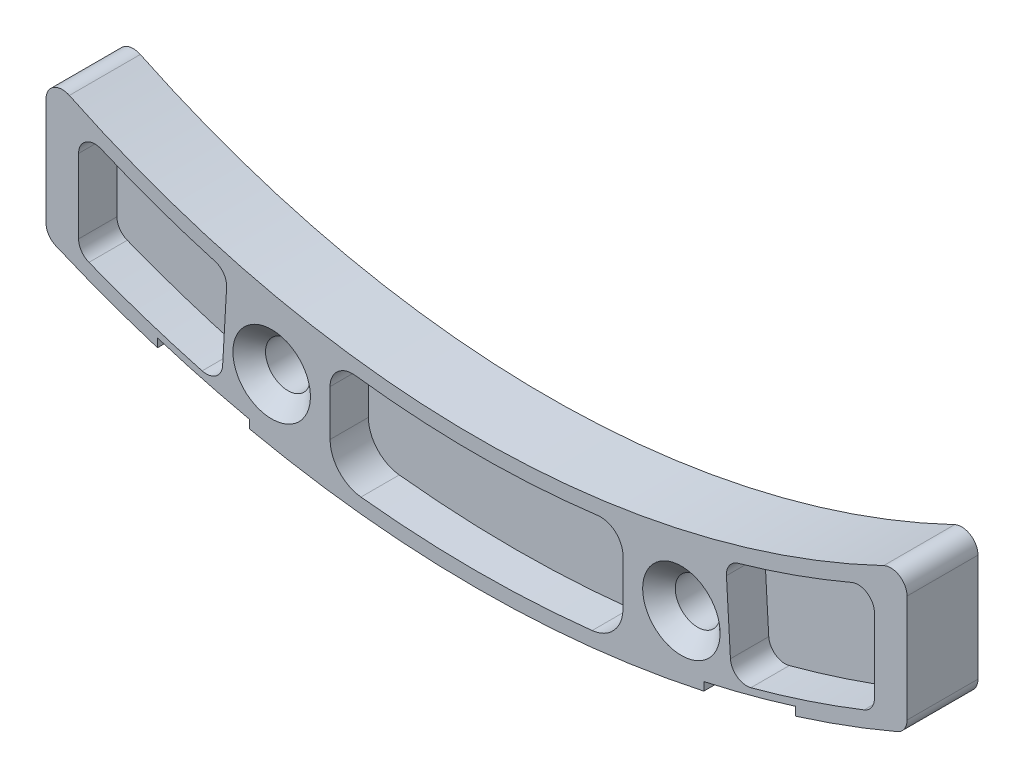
ISO-10303-21;
HEADER;
FILE_DESCRIPTION(('STEP AP214'),'2;1');
FILE_NAME('part.step','',(''),(''),'','','');
FILE_SCHEMA(('AUTOMOTIVE_DESIGN { 1 0 10303 214 1 1 1 1 }'));
ENDSEC;
DATA;
#1=APPLICATION_CONTEXT('core data for automotive mechanical design processes');
#2=APPLICATION_PROTOCOL_DEFINITION('international standard','automotive_design',2000,#1);
#3=PRODUCT_CONTEXT('',#1,'mechanical');
#4=PRODUCT('Part','Part','',(#3));
#5=PRODUCT_RELATED_PRODUCT_CATEGORY('part','',(#4));
#6=PRODUCT_DEFINITION_FORMATION('','',#4);
#7=PRODUCT_DEFINITION_CONTEXT('part definition',#1,'design');
#8=PRODUCT_DEFINITION('design','',#6,#7);
#9=PRODUCT_DEFINITION_SHAPE('','',#8);
#10=(LENGTH_UNIT() NAMED_UNIT(*) SI_UNIT(.MILLI.,.METRE.));
#11=(NAMED_UNIT(*) PLANE_ANGLE_UNIT() SI_UNIT($,.RADIAN.));
#12=(NAMED_UNIT(*) SI_UNIT($,.STERADIAN.) SOLID_ANGLE_UNIT());
#13=UNCERTAINTY_MEASURE_WITH_UNIT(LENGTH_MEASURE(1.E-05),#10,'distance_accuracy_value','');
#14=(GEOMETRIC_REPRESENTATION_CONTEXT(3) GLOBAL_UNCERTAINTY_ASSIGNED_CONTEXT((#13)) GLOBAL_UNIT_ASSIGNED_CONTEXT((#10,
#11,#12)) REPRESENTATION_CONTEXT('',''));
#15=CARTESIAN_POINT('',(0.,0.,0.));
#16=DIRECTION('',(0.,0.,1.));
#17=DIRECTION('',(1.,0.,0.));
#18=AXIS2_PLACEMENT_3D('',#15,#16,#17);
#19=CARTESIAN_POINT('',(0.,0.,0.));
#20=DIRECTION('',(0.,0.,-1.));
#21=DIRECTION('',(-1.,0.,0.));
#22=AXIS2_PLACEMENT_3D('',#19,#20,#21);
#23=PLANE('',#22);
#24=CARTESIAN_POINT('',(25.0646879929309,-65.8240674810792,0.));
#25=CARTESIAN_POINT('',(25.0723644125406,-65.7139783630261,0.));
#26=CARTESIAN_POINT('',(25.0751980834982,-65.6036332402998,0.));
#27=CARTESIAN_POINT('',(25.0715958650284,-65.3831578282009,0.));
#28=CARTESIAN_POINT('',(25.0651657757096,-65.2730274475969,0.));
#29=CARTESIAN_POINT('',(25.0326320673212,-64.944083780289,0.));
#30=CARTESIAN_POINT('',(24.9933001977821,-64.7264702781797,0.));
#31=CARTESIAN_POINT('',(24.8821866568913,-64.299933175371,0.));
#32=CARTESIAN_POINT('',(24.8104131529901,-64.0910074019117,0.));
#33=CARTESIAN_POINT('',(24.6365230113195,-63.6861548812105,0.));
#34=CARTESIAN_POINT('',(24.5344069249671,-63.4902278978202,1.11835844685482E-13));
#35=CARTESIAN_POINT('',(24.3014461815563,-63.1161351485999,-1.26606166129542E-13));
#36=CARTESIAN_POINT('',(24.1705954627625,-62.937973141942,-4.47011122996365E-13));
#37=CARTESIAN_POINT('',(23.8855919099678,-62.6096091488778,-4.29269294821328E-13));
#38=CARTESIAN_POINT('',(23.7321711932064,-62.4587775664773,-1.08829487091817E-13));
#39=CARTESIAN_POINT('',(23.4184669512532,-62.1998798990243,0.));
#40=CARTESIAN_POINT('',(23.2605105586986,-62.0890113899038,0.));
#41=CARTESIAN_POINT('',(22.9451597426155,-61.9064594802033,0.));
#42=CARTESIAN_POINT('',(22.78948165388,-61.8318676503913,0.));
#43=CARTESIAN_POINT('',(22.5562757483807,-61.7441598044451,0.));
#44=CARTESIAN_POINT('',(22.4828693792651,-61.7197986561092,0.));
#45=CARTESIAN_POINT('',(22.3342993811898,-61.6772163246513,0.));
#46=CARTESIAN_POINT('',(22.2591363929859,-61.6589929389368,0.));
#47=CARTESIAN_POINT('',(22.1141567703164,-61.6304489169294,0.));
#48=CARTESIAN_POINT('',(22.044449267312,-61.619575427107,0.));
#49=CARTESIAN_POINT('',(21.9043251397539,-61.6036190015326,0.));
#50=CARTESIAN_POINT('',(21.8339079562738,-61.5985410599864,0.));
#51=CARTESIAN_POINT('',(21.6300319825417,-61.5926851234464,0.));
#52=CARTESIAN_POINT('',(21.4962390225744,-61.5997553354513,0.));
#53=CARTESIAN_POINT('',(21.2317917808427,-61.6369248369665,0.));
#54=CARTESIAN_POINT('',(21.1011395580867,-61.6670388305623,0.));
#55=CARTESIAN_POINT('',(20.8498780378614,-61.7492440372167,0.));
#56=CARTESIAN_POINT('',(20.7291178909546,-61.8008726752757,0.));
#57=CARTESIAN_POINT('',(20.498493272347,-61.924377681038,0.));
#58=CARTESIAN_POINT('',(20.3886268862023,-61.9962504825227,0.));
#59=CARTESIAN_POINT('',(20.1859526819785,-62.1548121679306,0.));
#60=CARTESIAN_POINT('',(20.0927080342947,-62.2409466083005,0.));
#61=CARTESIAN_POINT('',(19.9205834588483,-62.4264807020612,0.));
#62=CARTESIAN_POINT('',(19.8417066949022,-62.5258832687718,0.));
#63=CARTESIAN_POINT('',(19.6925500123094,-62.7442532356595,0.));
#64=CARTESIAN_POINT('',(19.6236755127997,-62.8641757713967,0.));
#65=CARTESIAN_POINT('',(19.5035356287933,-63.1127358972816,0.));
#66=CARTESIAN_POINT('',(19.4523078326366,-63.2413914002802,0.));
#67=CARTESIAN_POINT('',(19.3595259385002,-63.5271684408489,0.));
#68=CARTESIAN_POINT('',(19.3212207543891,-63.6853391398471,0.));
#69=CARTESIAN_POINT('',(19.266817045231,-64.0052050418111,0.));
#70=CARTESIAN_POINT('',(19.2506965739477,-64.1668966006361,0.));
#71=CARTESIAN_POINT('',(19.2413935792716,-64.4257140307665,0.));
#72=CARTESIAN_POINT('',(19.2415948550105,-64.522663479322,0.));
#73=CARTESIAN_POINT('',(19.2490541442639,-64.7162292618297,0.));
#74=CARTESIAN_POINT('',(19.2563076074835,-64.8128457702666,0.));
#75=CARTESIAN_POINT('',(19.2841410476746,-65.0646083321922,0.));
#76=CARTESIAN_POINT('',(19.3101761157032,-65.2191698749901,0.));
#77=CARTESIAN_POINT('',(19.3789945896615,-65.5247844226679,0.));
#78=CARTESIAN_POINT('',(19.4218042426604,-65.6758315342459,0.));
#79=CARTESIAN_POINT('',(19.4724892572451,-65.8240674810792,0.));
#80=B_SPLINE_CURVE_WITH_KNOTS('',3,(#24,#25,#26,#27,#28,#29,#30,#31,#32,#33,#34,#35,#36,#37,#38,
#39,#40,#41,#42,#43,#44,#45,#46,#47,#48,#49,#50,#51,#52,#53,#54,#55,#56,#57,#58,#59,#60,#61,#62,
#63,#64,#65,#66,#67,#68,#69,#70,#71,#72,#73,#74,#75,#76,#77,#78,#79),.UNSPECIFIED.,.F.,.F.,(4,2,
2,2,2,2,2,2,2,2,2,2,2,2,2,2,2,2,2,2,2,2,2,2,2,2,2,4),(0.,0.330821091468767,0.661435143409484,
1.32192770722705,1.98225407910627,2.64256845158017,3.30302225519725,3.94547934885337,
4.52188666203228,5.03717544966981,5.26899190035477,5.50072507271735,5.71213801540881,
5.92373300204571,6.32363193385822,6.72378625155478,7.11574798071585,7.50764070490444,
7.88685717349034,8.26615704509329,8.67947398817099,9.09366595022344,9.58014875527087,
10.0661499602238,10.3567651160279,10.6471928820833,11.1164136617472,11.586371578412),.UNSPECIFIED.);
#81=CARTESIAN_POINT('',(20.469011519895,-61.9472499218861,3.57266299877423E-12));
#82=VERTEX_POINT('',#81);
#83=CARTESIAN_POINT('',(19.7143062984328,-62.7158651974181,0.));
#84=VERTEX_POINT('',#83);
#85=EDGE_CURVE('E873',#82,#84,#80,.T.);
#86=ORIENTED_EDGE('',*,*,#85,.T.);
#87=CARTESIAN_POINT('',(0.,0.,0.));
#88=DIRECTION('',(0.,0.,1.));
#89=DIRECTION('',(1.,0.,0.));
#90=AXIS2_PLACEMENT_3D('',#87,#88,#89);
#91=CIRCLE('',#90,65.7414148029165);
#92=CARTESIAN_POINT('',(19.563600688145,-62.7630396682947,0.));
#93=VERTEX_POINT('',#92);
#94=EDGE_CURVE('E583',#93,#84,#91,.T.);
#95=ORIENTED_EDGE('',*,*,#94,.F.);
#96=DIRECTION('',(0.,-1.,0.));
#97=VECTOR('',#96,1.);
#98=CARTESIAN_POINT('',(19.563600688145,-62.7630396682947,0.));
#99=LINE('',#98,#97);
#100=CARTESIAN_POINT('',(19.563600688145,-62.2391173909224,0.));
#101=VERTEX_POINT('',#100);
#102=EDGE_CURVE('E588',#101,#93,#99,.T.);
#103=ORIENTED_EDGE('',*,*,#102,.F.);
#104=CARTESIAN_POINT('',(0.,0.,0.));
#105=DIRECTION('',(0.,0.,-1.));
#106=DIRECTION('',(1.,0.,0.));
#107=AXIS2_PLACEMENT_3D('',#104,#105,#106);
#108=CIRCLE('',#107,65.2414148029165);
#109=EDGE_CURVE('E392',#82,#101,#108,.T.);
#110=ORIENTED_EDGE('',*,*,#109,.F.);
#111=EDGE_LOOP('',(#86,#95,#103,#110));
#112=FACE_BOUND('',#111,.T.);
#113=ADVANCED_FACE('F38',(#112),#23,.T.);
#114=CARTESIAN_POINT('',(0.,0.,58.9174163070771));
#115=DIRECTION('',(0.,0.,-1.));
#116=DIRECTION('',(-1.,0.,0.));
#117=AXIS2_PLACEMENT_3D('',#114,#115,#116);
#118=CYLINDRICAL_SURFACE('',#117,65.2414148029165);
#119=CARTESIAN_POINT('',(0.,0.,-52.4967537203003));
#120=DIRECTION('',(-0.214229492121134,0.586027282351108,0.781458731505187));
#121=DIRECTION('',(-0.268306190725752,0.733954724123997,-0.623956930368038));
#122=AXIS2_PLACEMENT_3D('',#119,#120,#121);
#123=ELLIPSE('',#122,83.4867052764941,65.2414148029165);
#124=CARTESIAN_POINT('',(19.4528306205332,-62.2738274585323,-0.463894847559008));
#125=VERTEX_POINT('',#124);
#126=CARTESIAN_POINT('',(19.4000001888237,-62.2903058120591,-0.466020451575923));
#127=VERTEX_POINT('',#126);
#128=EDGE_CURVE('E381',#125,#127,#123,.F.);
#129=ORIENTED_EDGE('',*,*,#128,.F.);
#130=CARTESIAN_POINT('',(22.39999986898,-61.2754617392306,-0.404645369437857));
#131=CARTESIAN_POINT('',(22.3439578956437,-61.2959487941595,-0.36529533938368));
#132=CARTESIAN_POINT('',(22.2865006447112,-61.3168655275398,-0.328228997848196));
#133=CARTESIAN_POINT('',(22.1688713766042,-61.3594920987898,-0.258789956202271));
#134=CARTESIAN_POINT('',(22.1086925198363,-61.3812039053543,-0.226430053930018));
#135=CARTESIAN_POINT('',(21.9233449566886,-61.4477539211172,-0.136234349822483));
#136=CARTESIAN_POINT('',(21.7946282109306,-61.4935439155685,-0.0861726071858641));
#137=CARTESIAN_POINT('',(21.5311146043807,-61.5863034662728,-0.00835957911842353));
#138=CARTESIAN_POINT('',(21.396322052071,-61.633272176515,0.0194072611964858));
#139=CARTESIAN_POINT('',(21.1889120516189,-61.7047643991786,0.0441154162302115));
#140=CARTESIAN_POINT('',(21.1172216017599,-61.7293360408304,0.049437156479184));
#141=CARTESIAN_POINT('',(20.9736185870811,-61.7782750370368,0.0537025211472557));
#142=CARTESIAN_POINT('',(20.9017062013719,-61.8026425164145,0.0526503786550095));
#143=CARTESIAN_POINT('',(20.758702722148,-61.8508214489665,0.0442116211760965));
#144=CARTESIAN_POINT('',(20.6876096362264,-61.8746357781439,0.0368752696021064));
#145=CARTESIAN_POINT('',(20.546178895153,-61.9217434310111,0.0160138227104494));
#146=CARTESIAN_POINT('',(20.4758413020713,-61.9450367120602,0.00248822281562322));
#147=CARTESIAN_POINT('',(20.2666931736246,-62.0139080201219,-0.0472293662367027));
#148=CARTESIAN_POINT('',(20.1296078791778,-62.0585244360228,-0.092570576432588));
#149=CARTESIAN_POINT('',(19.893210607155,-62.1346465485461,-0.193618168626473));
#150=CARTESIAN_POINT('',(19.7921909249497,-62.1668865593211,-0.244893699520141));
#151=CARTESIAN_POINT('',(19.5967913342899,-62.2287600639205,-0.360419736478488));
#152=CARTESIAN_POINT('',(19.5024210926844,-62.2583897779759,-0.424688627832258));
#153=CARTESIAN_POINT('',(19.4121638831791,-62.2865161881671,-0.494916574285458));
#154=B_SPLINE_CURVE_WITH_KNOTS('',3,(#130,#131,#132,#133,#134,#135,#136,#137,#138,#139,#140,
#141,#142,#143,#144,#145,#146,#147,#148,#149,#150,#151,#152,#153),.UNSPECIFIED.,.F.,.F.,(4,2,2,
2,2,2,2,2,2,2,2,4),(0.,0.214326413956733,0.42922514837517,0.863808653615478,1.29808869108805,
1.52577236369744,1.75330484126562,1.97903424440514,2.20478205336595,2.65584096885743,
3.00832304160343,3.36130740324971),.UNSPECIFIED.);
#155=EDGE_CURVE('E53',#82,#125,#154,.T.);
#156=ORIENTED_EDGE('',*,*,#155,.F.);
#157=ORIENTED_EDGE('',*,*,#109,.T.);
#158=DIRECTION('',(0.,0.,-1.));
#159=VECTOR('',#158,1.);
#160=CARTESIAN_POINT('',(19.563600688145,-62.2391173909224,58.9174163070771));
#161=LINE('',#160,#159);
#162=CARTESIAN_POINT('',(19.563600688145,-62.2391173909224,4.35));
#163=VERTEX_POINT('',#162);
#164=EDGE_CURVE('E592',#163,#101,#161,.T.);
#165=ORIENTED_EDGE('',*,*,#164,.F.);
#166=CARTESIAN_POINT('',(0.,0.,4.35));
#167=DIRECTION('',(0.,0.,-1.));
#168=DIRECTION('',(-1.,0.,0.));
#169=AXIS2_PLACEMENT_3D('',#166,#167,#168);
#170=CIRCLE('',#169,65.2414148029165);
#171=CARTESIAN_POINT('',(13.936315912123,-63.7355576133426,4.35));
#172=VERTEX_POINT('',#171);
#173=EDGE_CURVE('E518',#163,#172,#170,.T.);
#174=ORIENTED_EDGE('',*,*,#173,.T.);
#175=DIRECTION('',(0.,0.,-1.));
#176=VECTOR('',#175,1.);
#177=CARTESIAN_POINT('',(13.936315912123,-63.7355576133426,58.9174163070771));
#178=LINE('',#177,#176);
#179=CARTESIAN_POINT('',(13.936315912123,-63.7355576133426,0.));
#180=VERTEX_POINT('',#179);
#181=EDGE_CURVE('E597',#172,#180,#178,.T.);
#182=ORIENTED_EDGE('',*,*,#181,.T.);
#183=CARTESIAN_POINT('',(0.,0.,0.));
#184=DIRECTION('',(0.,0.,1.));
#185=DIRECTION('',(-1.,0.,0.));
#186=AXIS2_PLACEMENT_3D('',#183,#184,#185);
#187=CIRCLE('',#186,65.2414148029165);
#188=CARTESIAN_POINT('',(19.4000001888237,-62.2903058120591,0.));
#189=VERTEX_POINT('',#188);
#190=EDGE_CURVE('E593',#180,#189,#187,.T.);
#191=ORIENTED_EDGE('',*,*,#190,.T.);
#192=DIRECTION('',(0.,0.,1.));
#193=VECTOR('',#192,1.);
#194=CARTESIAN_POINT('',(19.4000001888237,-62.2903058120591,-2.8));
#195=LINE('',#194,#193);
#196=EDGE_CURVE('E409',#127,#189,#195,.T.);
#197=ORIENTED_EDGE('',*,*,#196,.F.);
#198=EDGE_LOOP('',(#129,#156,#157,#165,#174,#182,#191,#197));
#199=FACE_BOUND('',#198,.T.);
#200=ADVANCED_FACE('F869',(#199),#118,.T.);
#201=CARTESIAN_POINT('',(0.,0.,58.9174163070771));
#202=DIRECTION('',(0.,0.,-1.));
#203=DIRECTION('',(-1.,0.,0.));
#204=AXIS2_PLACEMENT_3D('',#201,#202,#203);
#205=CYLINDRICAL_SURFACE('',#204,65.2414148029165);
#206=CARTESIAN_POINT('',(-22.3831403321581,-61.2816223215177,-0.546506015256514));
#207=CARTESIAN_POINT('',(-22.3273196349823,-61.3020114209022,-0.502583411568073));
#208=CARTESIAN_POINT('',(-22.2698475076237,-61.3229161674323,-0.460994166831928));
#209=CARTESIAN_POINT('',(-22.1519154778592,-61.3656154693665,-0.382738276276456));
#210=CARTESIAN_POINT('',(-22.091454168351,-61.387410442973,-0.346073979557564));
#211=CARTESIAN_POINT('',(-21.9681022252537,-61.4316610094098,-0.278070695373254));
#212=CARTESIAN_POINT('',(-21.9052196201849,-61.4541143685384,-0.246715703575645));
#213=CARTESIAN_POINT('',(-21.7772553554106,-61.4995769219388,-0.189444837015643));
#214=CARTESIAN_POINT('',(-21.7121746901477,-61.5225858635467,-0.163526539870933));
#215=CARTESIAN_POINT('',(-21.5769221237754,-61.5701553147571,-0.116174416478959));
#216=CARTESIAN_POINT('',(-21.5066575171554,-61.5947363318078,-0.095025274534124));
#217=CARTESIAN_POINT('',(-21.3646253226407,-61.6441452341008,-0.0591194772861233));
#218=CARTESIAN_POINT('',(-21.2928582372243,-61.6689730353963,-0.0443607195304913));
#219=CARTESIAN_POINT('',(-21.150291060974,-61.7180113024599,-0.0216765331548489));
#220=CARTESIAN_POINT('',(-21.0795183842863,-61.7422200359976,-0.0135748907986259));
#221=CARTESIAN_POINT('',(-20.9375055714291,-61.790522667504,-0.00360857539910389));
#222=CARTESIAN_POINT('',(-20.8662654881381,-61.8146165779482,-0.00174320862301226));
#223=CARTESIAN_POINT('',(-20.723821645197,-61.8625174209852,-0.00426634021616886));
#224=CARTESIAN_POINT('',(-20.6526178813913,-61.8863244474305,-0.00865273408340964));
#225=CARTESIAN_POINT('',(-20.510679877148,-61.933511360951,-0.0236341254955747));
#226=CARTESIAN_POINT('',(-20.4399460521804,-61.9568908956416,-0.0342340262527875));
#227=CARTESIAN_POINT('',(-20.2273896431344,-62.0267462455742,-0.0756030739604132));
#228=CARTESIAN_POINT('',(-20.0870198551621,-62.0723312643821,-0.115909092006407));
#229=CARTESIAN_POINT('',(-19.8142179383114,-62.1599513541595,-0.220396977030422));
#230=CARTESIAN_POINT('',(-19.6817895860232,-62.2019847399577,-0.284590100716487));
#231=CARTESIAN_POINT('',(-19.507570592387,-62.2567218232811,-0.387777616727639));
#232=CARTESIAN_POINT('',(-19.4607432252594,-62.2713738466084,-0.417532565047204));
#233=CARTESIAN_POINT('',(-19.3689993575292,-62.2999708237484,-0.479897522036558));
#234=CARTESIAN_POINT('',(-19.3240780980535,-62.313917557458,-0.512499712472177));
#235=CARTESIAN_POINT('',(-19.2801077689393,-62.3275192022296,-0.546506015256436));
#236=B_SPLINE_CURVE_WITH_KNOTS('',3,(#206,#207,#208,#209,#210,#211,#212,#213,#214,#215,#216,
#217,#218,#219,#220,#221,#222,#223,#224,#225,#226,#227,#228,#229,#230,#231,#232,#233,#234,#235),
.UNSPECIFIED.,.F.,.F.,(4,2,2,2,2,2,2,2,2,2,2,2,2,2,4),(0.,0.221640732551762,0.443386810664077,
0.664452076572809,0.885418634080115,1.11729784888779,1.34910071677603,1.57454984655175,
1.79997389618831,2.02532208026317,2.25084833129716,2.70755134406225,3.16446984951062,
3.33653605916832,3.50814381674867),.UNSPECIFIED.);
#237=CARTESIAN_POINT('',(-22.2630545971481,-61.3253504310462,-0.457402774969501));
#238=VERTEX_POINT('',#237);
#239=CARTESIAN_POINT('',(-19.4000001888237,-62.2903058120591,-0.458895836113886));
#240=VERTEX_POINT('',#239);
#241=EDGE_CURVE('E61',#238,#240,#236,.T.);
#242=ORIENTED_EDGE('',*,*,#241,.T.);
#243=DIRECTION('',(0.,0.,1.));
#244=VECTOR('',#243,1.);
#245=CARTESIAN_POINT('',(-19.4000001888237,-62.2903058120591,-2.8));
#246=LINE('',#245,#244);
#247=CARTESIAN_POINT('',(-19.4000001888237,-62.2903058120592,0.));
#248=VERTEX_POINT('',#247);
#249=EDGE_CURVE('E422',#240,#248,#246,.T.);
#250=ORIENTED_EDGE('',*,*,#249,.T.);
#251=CARTESIAN_POINT('',(0.,0.,0.));
#252=DIRECTION('',(0.,0.,1.));
#253=DIRECTION('',(1.,0.,0.));
#254=AXIS2_PLACEMENT_3D('',#251,#252,#253);
#255=CIRCLE('',#254,65.2414148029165);
#256=CARTESIAN_POINT('',(-13.936315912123,-63.7355576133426,0.));
#257=VERTEX_POINT('',#256);
#258=EDGE_CURVE('E534',#248,#257,#255,.T.);
#259=ORIENTED_EDGE('',*,*,#258,.T.);
#260=DIRECTION('',(0.,0.,-1.));
#261=VECTOR('',#260,1.);
#262=CARTESIAN_POINT('',(-13.936315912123,-63.7355576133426,58.9174163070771));
#263=LINE('',#262,#261);
#264=CARTESIAN_POINT('',(-13.936315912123,-63.7355576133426,4.35));
#265=VERTEX_POINT('',#264);
#266=EDGE_CURVE('E533',#265,#257,#263,.T.);
#267=ORIENTED_EDGE('',*,*,#266,.F.);
#268=CARTESIAN_POINT('',(0.,0.,4.35));
#269=DIRECTION('',(0.,0.,-1.));
#270=DIRECTION('',(-1.,0.,0.));
#271=AXIS2_PLACEMENT_3D('',#268,#269,#270);
#272=CIRCLE('',#271,65.2414148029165);
#273=CARTESIAN_POINT('',(-19.563600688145,-62.2391173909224,4.35));
#274=VERTEX_POINT('',#273);
#275=EDGE_CURVE('E541',#265,#274,#272,.T.);
#276=ORIENTED_EDGE('',*,*,#275,.T.);
#277=DIRECTION('',(0.,0.,-1.));
#278=VECTOR('',#277,1.);
#279=CARTESIAN_POINT('',(-19.563600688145,-62.2391173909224,58.9174163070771));
#280=LINE('',#279,#278);
#281=CARTESIAN_POINT('',(-19.563600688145,-62.2391173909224,0.));
#282=VERTEX_POINT('',#281);
#283=EDGE_CURVE('E537',#274,#282,#280,.T.);
#284=ORIENTED_EDGE('',*,*,#283,.T.);
#285=CARTESIAN_POINT('',(0.,0.,0.));
#286=DIRECTION('',(0.,0.,-1.));
#287=DIRECTION('',(-1.,0.,0.));
#288=AXIS2_PLACEMENT_3D('',#285,#286,#287);
#289=CIRCLE('',#288,65.2414148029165);
#290=CARTESIAN_POINT('',(-22.39999986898,-61.2754617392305,0.));
#291=VERTEX_POINT('',#290);
#292=EDGE_CURVE('E411',#282,#291,#289,.T.);
#293=ORIENTED_EDGE('',*,*,#292,.T.);
#294=DIRECTION('',(0.,0.,1.));
#295=VECTOR('',#294,1.);
#296=CARTESIAN_POINT('',(-22.39999986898,-61.2754617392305,-2.8));
#297=LINE('',#296,#295);
#298=CARTESIAN_POINT('',(-22.3999998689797,-61.2754617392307,-0.457275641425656));
#299=VERTEX_POINT('',#298);
#300=EDGE_CURVE('E429',#299,#291,#297,.T.);
#301=ORIENTED_EDGE('',*,*,#300,.F.);
#302=CARTESIAN_POINT('',(0.,0.,-51.4048261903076));
#303=DIRECTION('',(0.211317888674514,0.578062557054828,0.788155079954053));
#304=DIRECTION('',(0.270605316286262,0.740244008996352,-0.615476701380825));
#305=AXIS2_PLACEMENT_3D('',#302,#303,#304);
#306=ELLIPSE('',#305,82.7773828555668,65.2414148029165);
#307=EDGE_CURVE('E382',#238,#299,#306,.F.);
#308=ORIENTED_EDGE('',*,*,#307,.F.);
#309=EDGE_LOOP('',(#242,#250,#259,#267,#276,#284,#293,#301,#308));
#310=FACE_BOUND('',#309,.T.);
#311=ADVANCED_FACE('F855',(#310),#205,.T.);
#312=CARTESIAN_POINT('',(0.,0.,-2.8));
#313=DIRECTION('',(0.,0.,1.));
#314=DIRECTION('',(1.,0.,0.));
#315=AXIS2_PLACEMENT_3D('',#312,#313,#314);
#316=CYLINDRICAL_SURFACE('',#315,62.2414148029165);
#317=CARTESIAN_POINT('',(-18.5079287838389,-59.426006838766,-2.79885998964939));
#318=CARTESIAN_POINT('',(-18.5668719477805,-59.4076499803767,-2.75820939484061));
#319=CARTESIAN_POINT('',(-18.6273245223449,-59.3887254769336,-2.71999837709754));
#320=CARTESIAN_POINT('',(-18.7508944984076,-59.3498260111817,-2.64869777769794));
#321=CARTESIAN_POINT('',(-18.8140131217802,-59.3298505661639,-2.61561057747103));
#322=CARTESIAN_POINT('',(-18.9423050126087,-59.2890151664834,-2.55493304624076));
#323=CARTESIAN_POINT('',(-19.00747123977,-59.2681581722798,-2.52732585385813));
#324=CARTESIAN_POINT('',(-19.1396027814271,-59.2256206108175,-2.47770682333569));
#325=CARTESIAN_POINT('',(-19.2065672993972,-59.2039404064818,-2.45569255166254));
#326=CARTESIAN_POINT('',(-19.3447640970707,-59.1589326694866,-2.41661400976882));
#327=CARTESIAN_POINT('',(-19.4160570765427,-59.1355742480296,-2.39979855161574));
#328=CARTESIAN_POINT('',(-19.5596068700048,-59.0882494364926,-2.37258123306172));
#329=CARTESIAN_POINT('',(-19.6318633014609,-59.0642832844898,-2.36217690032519));
#330=CARTESIAN_POINT('',(-19.8459832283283,-58.9928202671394,-2.34106921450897));
#331=CARTESIAN_POINT('',(-19.988627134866,-58.9446425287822,-2.33951045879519));
#332=CARTESIAN_POINT('',(-20.2718280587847,-58.8478471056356,-2.36134270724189));
#333=CARTESIAN_POINT('',(-20.4123851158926,-58.7992294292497,-2.38473323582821));
#334=CARTESIAN_POINT('',(-20.6218080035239,-58.7259789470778,-2.43860749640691));
#335=CARTESIAN_POINT('',(-20.6928872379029,-58.7009681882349,-2.46038456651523));
#336=CARTESIAN_POINT('',(-20.83297044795,-58.6513986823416,-2.51029696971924));
#337=CARTESIAN_POINT('',(-20.9019741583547,-58.6268399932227,-2.5384331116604));
#338=CARTESIAN_POINT('',(-21.039461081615,-58.577643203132,-2.60176007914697));
#339=CARTESIAN_POINT('',(-21.1078644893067,-58.5530254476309,-2.63713960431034));
#340=CARTESIAN_POINT('',(-21.2414518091,-58.5046965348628,-2.71404397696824));
#341=CARTESIAN_POINT('',(-21.3066360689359,-58.4809852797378,-2.75556815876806));
#342=CARTESIAN_POINT('',(-21.3699792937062,-58.4578284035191,-2.7999999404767));
#343=B_SPLINE_CURVE_WITH_KNOTS('',3,(#317,#318,#319,#320,#321,#322,#323,#324,#325,#326,#327,
#328,#329,#330,#331,#332,#333,#334,#335,#336,#337,#338,#339,#340,#341,#342),.UNSPECIFIED.,.F.,
.F.,(4,2,2,2,2,2,2,2,2,2,2,2,4),(0.,0.221698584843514,0.443499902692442,0.664607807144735,
0.885619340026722,1.11598086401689,1.34625349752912,1.79574303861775,2.24522401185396,
2.48028452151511,2.71537494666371,2.95762266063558,3.19984414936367),.UNSPECIFIED.);
#344=CARTESIAN_POINT('',(-18.5079287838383,-59.4260068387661,-2.79885998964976));
#345=VERTEX_POINT('',#344);
#346=CARTESIAN_POINT('',(-21.3699792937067,-58.4578284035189,-2.8));
#347=VERTEX_POINT('',#346);
#348=EDGE_CURVE('E894',#345,#347,#343,.T.);
#349=ORIENTED_EDGE('',*,*,#348,.T.);
#350=DIRECTION('',(0.,0.,1.));
#351=VECTOR('',#350,1.);
#352=CARTESIAN_POINT('',(-21.3699792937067,-58.4578284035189,-2.8));
#353=LINE('',#352,#351);
#354=CARTESIAN_POINT('',(-21.3699792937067,-58.4578284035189,0.));
#355=VERTEX_POINT('',#354);
#356=EDGE_CURVE('E426',#347,#355,#353,.T.);
#357=ORIENTED_EDGE('',*,*,#356,.T.);
#358=CARTESIAN_POINT('',(0.,0.,0.));
#359=DIRECTION('',(0.,0.,1.));
#360=DIRECTION('',(-1.,0.,0.));
#361=AXIS2_PLACEMENT_3D('',#358,#359,#360);
#362=CIRCLE('',#361,62.2414148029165);
#363=CARTESIAN_POINT('',(-18.5079287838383,-59.4260068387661,0.));
#364=VERTEX_POINT('',#363);
#365=EDGE_CURVE('E416',#355,#364,#362,.T.);
#366=ORIENTED_EDGE('',*,*,#365,.T.);
#367=DIRECTION('',(0.,0.,1.));
#368=VECTOR('',#367,1.);
#369=CARTESIAN_POINT('',(-18.5079287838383,-59.4260068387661,-2.8));
#370=LINE('',#369,#368);
#371=EDGE_CURVE('E424',#345,#364,#370,.T.);
#372=ORIENTED_EDGE('',*,*,#371,.F.);
#373=EDGE_LOOP('',(#349,#357,#366,#372));
#374=FACE_BOUND('',#373,.T.);
#375=ADVANCED_FACE('F1000',(#374),#316,.F.);
#376=CARTESIAN_POINT('',(-19.4000001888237,-62.2903058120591,-2.8));
#377=DIRECTION('',(-0.954766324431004,0.297357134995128,0.));
#378=DIRECTION('',(-0.297357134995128,-0.954766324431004,0.));
#379=AXIS2_PLACEMENT_3D('',#376,#377,#378);
#380=PLANE('',#379);
#381=DIRECTION('',(0.234468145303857,0.752839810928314,-0.615025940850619));
#382=VECTOR('',#381,1.);
#383=CARTESIAN_POINT('',(-21.4226477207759,-68.7847043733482,4.84664662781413));
#384=LINE('',#383,#382);
#385=EDGE_CURVE('E897',#240,#345,#384,.T.);
#386=ORIENTED_EDGE('',*,*,#385,.T.);
#387=ORIENTED_EDGE('',*,*,#371,.T.);
#388=DIRECTION('',(-0.297357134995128,-0.954766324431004,0.));
#389=VECTOR('',#388,1.);
#390=CARTESIAN_POINT('',(-19.4000001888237,-62.2903058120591,0.));
#391=LINE('',#390,#389);
#392=EDGE_CURVE('E419',#364,#248,#391,.T.);
#393=ORIENTED_EDGE('',*,*,#392,.T.);
#394=ORIENTED_EDGE('',*,*,#249,.F.);
#395=EDGE_LOOP('',(#386,#387,#393,#394));
#396=FACE_BOUND('',#395,.T.);
#397=ADVANCED_FACE('F994',(#396),#380,.F.);
#398=CARTESIAN_POINT('',(23.1186908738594,-74.7212098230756,-2.8));
#399=DIRECTION('',(0.211317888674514,0.578062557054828,0.788155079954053));
#400=DIRECTION('',(0.,-0.806364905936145,0.59141832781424));
#401=AXIS2_PLACEMENT_3D('',#398,#399,#400);
#402=PLANE('',#401);
#403=DIRECTION('',(0.234468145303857,0.752839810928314,-0.615025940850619));
#404=VECTOR('',#403,1.);
#405=CARTESIAN_POINT('',(-24.2846983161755,-67.8165259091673,4.84550661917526));
#406=LINE('',#405,#404);
#407=EDGE_CURVE('E892',#347,#238,#406,.F.);
#408=ORIENTED_EDGE('',*,*,#407,.T.);
#409=ORIENTED_EDGE('',*,*,#307,.T.);
#410=DIRECTION('',(0.270605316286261,0.740244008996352,-0.615476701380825));
#411=VECTOR('',#410,1.);
#412=CARTESIAN_POINT('',(-21.3699792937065,-58.457828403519,-2.8));
#413=LINE('',#412,#411);
#414=EDGE_CURVE('E385',#299,#347,#413,.T.);
#415=ORIENTED_EDGE('',*,*,#414,.T.);
#416=EDGE_LOOP('',(#408,#409,#415));
#417=FACE_BOUND('',#416,.T.);
#418=ADVANCED_FACE('F891',(#417),#402,.F.);
#419=CARTESIAN_POINT('',(22.5639217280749,-61.7478992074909,-2.61943244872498E-13));
#420=VERTEX_POINT('',#419);
#421=CARTESIAN_POINT('',(21.4761029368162,-61.6053504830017,0.));
#422=VERTEX_POINT('',#421);
#423=EDGE_CURVE('E875',#420,#422,#80,.T.);
#424=ORIENTED_EDGE('',*,*,#423,.T.);
#425=CARTESIAN_POINT('',(22.39999986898,-61.2754617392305,0.));
#426=VERTEX_POINT('',#425);
#427=EDGE_CURVE('E393',#426,#422,#108,.T.);
#428=ORIENTED_EDGE('',*,*,#427,.F.);
#429=DIRECTION('',(0.343340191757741,-0.939211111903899,0.));
#430=VECTOR('',#429,1.);
#431=CARTESIAN_POINT('',(22.39999986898,-61.2754617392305,0.));
#432=LINE('',#431,#430);
#433=CARTESIAN_POINT('',(21.3699792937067,-58.4578284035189,0.));
#434=VERTEX_POINT('',#433);
#435=EDGE_CURVE('E400',#434,#426,#432,.T.);
#436=ORIENTED_EDGE('',*,*,#435,.F.);
#437=CARTESIAN_POINT('',(0.,0.,0.));
#438=DIRECTION('',(0.,0.,1.));
#439=DIRECTION('',(1.,0.,0.));
#440=AXIS2_PLACEMENT_3D('',#437,#438,#439);
#441=CIRCLE('',#440,62.2414148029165);
#442=CARTESIAN_POINT('',(18.5079287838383,-59.4260068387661,0.));
#443=VERTEX_POINT('',#442);
#444=EDGE_CURVE('E398',#443,#434,#441,.T.);
#445=ORIENTED_EDGE('',*,*,#444,.F.);
#446=DIRECTION('',(-0.297357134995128,0.954766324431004,0.));
#447=VECTOR('',#446,1.);
#448=CARTESIAN_POINT('',(19.4000001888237,-62.2903058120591,0.));
#449=LINE('',#448,#447);
#450=EDGE_CURVE('E396',#189,#443,#449,.T.);
#451=ORIENTED_EDGE('',*,*,#450,.F.);
#452=ORIENTED_EDGE('',*,*,#190,.F.);
#453=DIRECTION('',(0.,1.,0.));
#454=VECTOR('',#453,1.);
#455=CARTESIAN_POINT('',(13.936315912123,-64.2472779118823,0.));
#456=LINE('',#455,#454);
#457=CARTESIAN_POINT('',(13.936315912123,-64.2472779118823,0.));
#458=VERTEX_POINT('',#457);
#459=EDGE_CURVE('E519',#458,#180,#456,.T.);
#460=ORIENTED_EDGE('',*,*,#459,.F.);
#461=CARTESIAN_POINT('',(0.,0.,0.));
#462=DIRECTION('',(0.,0.,1.));
#463=DIRECTION('',(1.,0.,0.));
#464=AXIS2_PLACEMENT_3D('',#461,#462,#463);
#465=CIRCLE('',#464,65.7414148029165);
#466=CARTESIAN_POINT('',(-13.936315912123,-64.2472779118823,0.));
#467=VERTEX_POINT('',#466);
#468=EDGE_CURVE('E524',#467,#458,#465,.T.);
#469=ORIENTED_EDGE('',*,*,#468,.F.);
#470=DIRECTION('',(0.,-1.,0.));
#471=VECTOR('',#470,1.);
#472=CARTESIAN_POINT('',(-13.936315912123,-64.2472779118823,0.));
#473=LINE('',#472,#471);
#474=EDGE_CURVE('E529',#257,#467,#473,.T.);
#475=ORIENTED_EDGE('',*,*,#474,.F.);
#476=ORIENTED_EDGE('',*,*,#258,.F.);
#477=ORIENTED_EDGE('',*,*,#392,.F.);
#478=ORIENTED_EDGE('',*,*,#365,.F.);
#479=DIRECTION('',(0.343340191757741,0.939211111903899,0.));
#480=VECTOR('',#479,1.);
#481=CARTESIAN_POINT('',(-22.39999986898,-61.2754617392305,0.));
#482=LINE('',#481,#480);
#483=EDGE_CURVE('E414',#291,#355,#482,.T.);
#484=ORIENTED_EDGE('',*,*,#483,.F.);
#485=ORIENTED_EDGE('',*,*,#292,.F.);
#486=DIRECTION('',(0.,1.,0.));
#487=VECTOR('',#486,1.);
#488=CARTESIAN_POINT('',(-19.563600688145,-62.7630396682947,0.));
#489=LINE('',#488,#487);
#490=CARTESIAN_POINT('',(-19.5636006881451,-62.7630396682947,0.));
#491=VERTEX_POINT('',#490);
#492=EDGE_CURVE('E538',#491,#282,#489,.T.);
#493=ORIENTED_EDGE('',*,*,#492,.F.);
#494=CARTESIAN_POINT('',(0.,0.,0.));
#495=DIRECTION('',(0.,0.,1.));
#496=DIRECTION('',(1.,0.,0.));
#497=AXIS2_PLACEMENT_3D('',#494,#495,#496);
#498=CIRCLE('',#497,65.7414148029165);
#499=CARTESIAN_POINT('',(-25.7923300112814,-60.4705658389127,0.));
#500=VERTEX_POINT('',#499);
#501=EDGE_CURVE('E543',#500,#491,#498,.T.);
#502=ORIENTED_EDGE('',*,*,#501,.F.);
#503=CARTESIAN_POINT('',(-25.4,-59.5507413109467,0.));
#504=DIRECTION('',(0.,0.,1.));
#505=DIRECTION('',(-1.,0.,0.));
#506=AXIS2_PLACEMENT_3D('',#503,#504,#505);
#507=CIRCLE('',#506,1.);
#508=CARTESIAN_POINT('',(-26.4,-59.5507413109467,0.));
#509=VERTEX_POINT('',#508);
#510=EDGE_CURVE('E548',#509,#500,#507,.T.);
#511=ORIENTED_EDGE('',*,*,#510,.F.);
#512=DIRECTION('',(0.,-1.,0.));
#513=VECTOR('',#512,1.);
#514=CARTESIAN_POINT('',(-26.4,-58.4531271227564,0.));
#515=LINE('',#514,#513);
#516=CARTESIAN_POINT('',(-26.4,-52.9659684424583,0.));
#517=VERTEX_POINT('',#516);
#518=EDGE_CURVE('E553',#517,#509,#515,.T.);
#519=ORIENTED_EDGE('',*,*,#518,.F.);
#520=CARTESIAN_POINT('',(-25.4,-52.9659684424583,0.));
#521=DIRECTION('',(0.,0.,1.));
#522=DIRECTION('',(1.,0.,0.));
#523=AXIS2_PLACEMENT_3D('',#520,#521,#522);
#524=CIRCLE('',#523,1.);
#525=CARTESIAN_POINT('',(-24.9675963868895,-52.064288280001,0.));
#526=VERTEX_POINT('',#525);
#527=EDGE_CURVE('E558',#526,#517,#524,.T.);
#528=ORIENTED_EDGE('',*,*,#527,.F.);
#529=CARTESIAN_POINT('',(0.,0.,0.));
#530=DIRECTION('',(0.,0.,-1.));
#531=DIRECTION('',(1.,0.,0.));
#532=AXIS2_PLACEMENT_3D('',#529,#530,#531);
#533=CIRCLE('',#532,57.7414148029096);
#534=CARTESIAN_POINT('',(24.9675963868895,-52.064288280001,0.));
#535=VERTEX_POINT('',#534);
#536=EDGE_CURVE('E563',#535,#526,#533,.T.);
#537=ORIENTED_EDGE('',*,*,#536,.F.);
#538=CARTESIAN_POINT('',(25.4,-52.9659684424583,0.));
#539=DIRECTION('',(0.,0.,1.));
#540=DIRECTION('',(-1.,0.,0.));
#541=AXIS2_PLACEMENT_3D('',#538,#539,#540);
#542=CIRCLE('',#541,1.);
#543=CARTESIAN_POINT('',(26.4,-52.9659684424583,0.));
#544=VERTEX_POINT('',#543);
#545=EDGE_CURVE('E568',#544,#535,#542,.T.);
#546=ORIENTED_EDGE('',*,*,#545,.F.);
#547=DIRECTION('',(0.,1.,0.));
#548=VECTOR('',#547,1.);
#549=CARTESIAN_POINT('',(26.4,-58.4531271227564,0.));
#550=LINE('',#549,#548);
#551=CARTESIAN_POINT('',(26.4,-59.5507413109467,0.));
#552=VERTEX_POINT('',#551);
#553=EDGE_CURVE('E573',#552,#544,#550,.T.);
#554=ORIENTED_EDGE('',*,*,#553,.F.);
#555=CARTESIAN_POINT('',(25.4,-59.5507413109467,0.));
#556=DIRECTION('',(0.,0.,1.));
#557=DIRECTION('',(1.,0.,0.));
#558=AXIS2_PLACEMENT_3D('',#555,#556,#557);
#559=CIRCLE('',#558,1.);
#560=CARTESIAN_POINT('',(25.7923300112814,-60.4705658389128,0.));
#561=VERTEX_POINT('',#560);
#562=EDGE_CURVE('E578',#561,#552,#559,.T.);
#563=ORIENTED_EDGE('',*,*,#562,.F.);
#564=EDGE_CURVE('E587',#420,#561,#91,.T.);
#565=ORIENTED_EDGE('',*,*,#564,.F.);
#566=EDGE_LOOP('',(#424,#428,#436,#445,#451,#452,#460,#469,#475,#476,#477,#478,#484,#485,#493,
#502,#511,#519,#528,#537,#546,#554,#563,#565));
#567=FACE_BOUND('',#566,.T.);
#568=CARTESIAN_POINT('',(-12.561315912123,-60.6669996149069,0.));
#569=DIRECTION('',(0.,0.,-1.));
#570=DIRECTION('',(-1.,0.,0.));
#571=AXIS2_PLACEMENT_3D('',#568,#569,#570);
#572=CIRCLE('',#571,2.475);
#573=CARTESIAN_POINT('',(-15.036315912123,-60.6669996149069,0.));
#574=VERTEX_POINT('',#573);
#575=EDGE_CURVE('E443',#574,#574,#572,.T.);
#576=ORIENTED_EDGE('',*,*,#575,.F.);
#577=EDGE_LOOP('',(#576));
#578=FACE_BOUND('',#577,.T.);
#579=CARTESIAN_POINT('',(12.561315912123,-60.6669996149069,0.));
#580=DIRECTION('',(0.,0.,-1.));
#581=DIRECTION('',(-1.,0.,0.));
#582=AXIS2_PLACEMENT_3D('',#579,#580,#581);
#583=CIRCLE('',#582,2.475);
#584=CARTESIAN_POINT('',(10.0863159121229,-60.6669996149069,0.));
#585=VERTEX_POINT('',#584);
#586=EDGE_CURVE('E434',#585,#585,#583,.T.);
#587=ORIENTED_EDGE('',*,*,#586,.F.);
#588=EDGE_LOOP('',(#587));
#589=FACE_BOUND('',#588,.T.);
#590=ADVANCED_FACE('F879',(#567,#578,#589),#23,.T.);
#591=CARTESIAN_POINT('',(-23.4,-54.8592595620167,58.9174163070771));
#592=DIRECTION('',(0.,0.,-1.));
#593=DIRECTION('',(-1.,0.,0.));
#594=AXIS2_PLACEMENT_3D('',#591,#592,#593);
#595=CYLINDRICAL_SURFACE('',#594,1.);
#596=DIRECTION('',(0.,0.,-1.));
#597=VECTOR('',#596,1.);
#598=CARTESIAN_POINT('',(-24.4,-54.8592595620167,58.9174163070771));
#599=LINE('',#598,#597);
#600=CARTESIAN_POINT('',(-24.4,-54.8592595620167,4.35));
#601=VERTEX_POINT('',#600);
#602=CARTESIAN_POINT('',(-24.4,-54.8592595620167,2.));
#603=VERTEX_POINT('',#602);
#604=EDGE_CURVE('E522',#601,#603,#599,.T.);
#605=ORIENTED_EDGE('',*,*,#604,.T.);
#606=CARTESIAN_POINT('',(-23.4,-54.8592595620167,2.));
#607=DIRECTION('',(0.,0.,-1.));
#608=DIRECTION('',(-1.,0.,0.));
#609=AXIS2_PLACEMENT_3D('',#606,#607,#608);
#610=CIRCLE('',#609,1.);
#611=CARTESIAN_POINT('',(-23.0076551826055,-53.9394413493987,2.));
#612=VERTEX_POINT('',#611);
#613=EDGE_CURVE('E515',#603,#612,#610,.T.);
#614=ORIENTED_EDGE('',*,*,#613,.T.);
#615=DIRECTION('',(0.,0.,-1.));
#616=VECTOR('',#615,1.);
#617=CARTESIAN_POINT('',(-23.0076551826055,-53.9394413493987,58.9174163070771));
#618=LINE('',#617,#616);
#619=CARTESIAN_POINT('',(-23.0076551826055,-53.9394413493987,4.35));
#620=VERTEX_POINT('',#619);
#621=EDGE_CURVE('E643',#620,#612,#618,.T.);
#622=ORIENTED_EDGE('',*,*,#621,.F.);
#623=CARTESIAN_POINT('',(-23.4,-54.8592595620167,4.35));
#624=DIRECTION('',(0.,0.,-1.));
#625=DIRECTION('',(-1.,0.,0.));
#626=AXIS2_PLACEMENT_3D('',#623,#624,#625);
#627=CIRCLE('',#626,1.);
#628=EDGE_CURVE('E726',#601,#620,#627,.T.);
#629=ORIENTED_EDGE('',*,*,#628,.F.);
#630=EDGE_LOOP('',(#605,#614,#622,#629));
#631=FACE_BOUND('',#630,.T.);
#632=ADVANCED_FACE('F986',(#631),#595,.F.);
#633=CARTESIAN_POINT('',(-24.4,-54.8592595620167,58.9174163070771));
#634=DIRECTION('',(1.,0.,0.));
#635=DIRECTION('',(0.,0.,-1.));
#636=AXIS2_PLACEMENT_3D('',#633,#634,#635);
#637=PLANE('',#636);
#638=DIRECTION('',(0.,0.,-1.));
#639=VECTOR('',#638,1.);
#640=CARTESIAN_POINT('',(-24.4,-59.3983690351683,58.9174163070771));
#641=LINE('',#640,#639);
#642=CARTESIAN_POINT('',(-24.4,-59.3983690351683,4.35));
#643=VERTEX_POINT('',#642);
#644=CARTESIAN_POINT('',(-24.4,-59.3983690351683,2.));
#645=VERTEX_POINT('',#644);
#646=EDGE_CURVE('E625',#643,#645,#641,.T.);
#647=ORIENTED_EDGE('',*,*,#646,.T.);
#648=DIRECTION('',(0.,1.,0.));
#649=VECTOR('',#648,1.);
#650=CARTESIAN_POINT('',(-24.4,-54.8592595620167,2.));
#651=LINE('',#650,#649);
#652=EDGE_CURVE('E512',#645,#603,#651,.T.);
#653=ORIENTED_EDGE('',*,*,#652,.T.);
#654=ORIENTED_EDGE('',*,*,#604,.F.);
#655=DIRECTION('',(0.,1.,0.));
#656=VECTOR('',#655,1.);
#657=CARTESIAN_POINT('',(-24.4,-54.8592595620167,4.35));
#658=LINE('',#657,#656);
#659=EDGE_CURVE('E730',#643,#601,#658,.T.);
#660=ORIENTED_EDGE('',*,*,#659,.F.);
#661=EDGE_LOOP('',(#647,#653,#654,#660));
#662=FACE_BOUND('',#661,.T.);
#663=ADVANCED_FACE('F990',(#662),#637,.T.);
#664=CARTESIAN_POINT('',(-23.4,-59.3983690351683,58.9174163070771));
#665=DIRECTION('',(0.,0.,-1.));
#666=DIRECTION('',(-1.,0.,0.));
#667=AXIS2_PLACEMENT_3D('',#664,#665,#666);
#668=CYLINDRICAL_SURFACE('',#667,1.);
#669=DIRECTION('',(0.,0.,-1.));
#670=VECTOR('',#669,1.);
#671=CARTESIAN_POINT('',(-23.7665332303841,-60.3287739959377,58.9174163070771));
#672=LINE('',#671,#670);
#673=CARTESIAN_POINT('',(-23.7665332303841,-60.3287739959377,4.35));
#674=VERTEX_POINT('',#673);
#675=CARTESIAN_POINT('',(-23.7665332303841,-60.3287739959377,2.));
#676=VERTEX_POINT('',#675);
#677=EDGE_CURVE('E628',#674,#676,#672,.T.);
#678=ORIENTED_EDGE('',*,*,#677,.T.);
#679=CARTESIAN_POINT('',(-23.4,-59.3983690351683,2.));
#680=DIRECTION('',(0.,0.,-1.));
#681=DIRECTION('',(-1.,0.,0.));
#682=AXIS2_PLACEMENT_3D('',#679,#680,#681);
#683=CIRCLE('',#682,1.);
#684=EDGE_CURVE('E509',#676,#645,#683,.T.);
#685=ORIENTED_EDGE('',*,*,#684,.T.);
#686=ORIENTED_EDGE('',*,*,#646,.F.);
#687=CARTESIAN_POINT('',(-23.4,-59.3983690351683,4.35));
#688=DIRECTION('',(0.,0.,-1.));
#689=DIRECTION('',(-1.,0.,0.));
#690=AXIS2_PLACEMENT_3D('',#687,#688,#689);
#691=CIRCLE('',#690,1.);
#692=EDGE_CURVE('E733',#674,#643,#691,.T.);
#693=ORIENTED_EDGE('',*,*,#692,.F.);
#694=EDGE_LOOP('',(#678,#685,#686,#693));
#695=FACE_BOUND('',#694,.T.);
#696=ADVANCED_FACE('F1070',(#695),#668,.F.);
#697=CARTESIAN_POINT('',(0.,0.,58.9174163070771));
#698=DIRECTION('',(0.,0.,-1.));
#699=DIRECTION('',(-1.,0.,0.));
#700=AXIS2_PLACEMENT_3D('',#697,#698,#699);
#701=CYLINDRICAL_SURFACE('',#700,64.8414148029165);
#702=DIRECTION('',(0.,0.,-1.));
#703=VECTOR('',#702,1.);
#704=CARTESIAN_POINT('',(-16.8269984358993,-62.6199744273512,58.9174163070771));
#705=LINE('',#704,#703);
#706=CARTESIAN_POINT('',(-16.8269984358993,-62.6199744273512,4.35));
#707=VERTEX_POINT('',#706);
#708=CARTESIAN_POINT('',(-16.8269984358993,-62.6199744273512,2.));
#709=VERTEX_POINT('',#708);
#710=EDGE_CURVE('E631',#707,#709,#705,.T.);
#711=ORIENTED_EDGE('',*,*,#710,.T.);
#712=CARTESIAN_POINT('',(0.,0.,2.));
#713=DIRECTION('',(0.,0.,-1.));
#714=DIRECTION('',(-1.,0.,0.));
#715=AXIS2_PLACEMENT_3D('',#712,#713,#714);
#716=CIRCLE('',#715,64.8414148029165);
#717=EDGE_CURVE('E506',#709,#676,#716,.T.);
#718=ORIENTED_EDGE('',*,*,#717,.T.);
#719=ORIENTED_EDGE('',*,*,#677,.F.);
#720=CARTESIAN_POINT('',(0.,0.,4.35));
#721=DIRECTION('',(0.,0.,-1.));
#722=DIRECTION('',(-1.,0.,0.));
#723=AXIS2_PLACEMENT_3D('',#720,#721,#722);
#724=CIRCLE('',#723,64.8414148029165);
#725=EDGE_CURVE('E735',#707,#674,#724,.T.);
#726=ORIENTED_EDGE('',*,*,#725,.F.);
#727=EDGE_LOOP('',(#711,#718,#719,#726));
#728=FACE_BOUND('',#727,.T.);
#729=ADVANCED_FACE('F1066',(#728),#701,.F.);
#730=CARTESIAN_POINT('',(-16.5674883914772,-61.6542340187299,58.9174163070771));
#731=DIRECTION('',(0.,0.,-1.));
#732=DIRECTION('',(-1.,0.,0.));
#733=AXIS2_PLACEMENT_3D('',#730,#731,#732);
#734=CYLINDRICAL_SURFACE('',#733,0.999999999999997);
#735=DIRECTION('',(0.,0.,-1.));
#736=VECTOR('',#735,1.);
#737=CARTESIAN_POINT('',(-15.5691093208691,-61.7111482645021,58.9174163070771));
#738=LINE('',#737,#736);
#739=CARTESIAN_POINT('',(-15.5691093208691,-61.7111482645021,4.35));
#740=VERTEX_POINT('',#739);
#741=CARTESIAN_POINT('',(-15.5691093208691,-61.7111482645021,2.));
#742=VERTEX_POINT('',#741);
#743=EDGE_CURVE('E634',#740,#742,#738,.T.);
#744=ORIENTED_EDGE('',*,*,#743,.T.);
#745=CARTESIAN_POINT('',(-16.5674883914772,-61.6542340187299,2.));
#746=DIRECTION('',(0.,0.,-1.));
#747=DIRECTION('',(-1.,0.,0.));
#748=AXIS2_PLACEMENT_3D('',#745,#746,#747);
#749=CIRCLE('',#748,0.999999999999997);
#750=EDGE_CURVE('E503',#742,#709,#749,.T.);
#751=ORIENTED_EDGE('',*,*,#750,.T.);
#752=ORIENTED_EDGE('',*,*,#710,.F.);
#753=CARTESIAN_POINT('',(-16.5674883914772,-61.6542340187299,4.35));
#754=DIRECTION('',(0.,0.,-1.));
#755=DIRECTION('',(-1.,0.,0.));
#756=AXIS2_PLACEMENT_3D('',#753,#754,#755);
#757=CIRCLE('',#756,0.999999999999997);
#758=EDGE_CURVE('E737',#740,#707,#757,.T.);
#759=ORIENTED_EDGE('',*,*,#758,.F.);
#760=EDGE_LOOP('',(#744,#751,#752,#759));
#761=FACE_BOUND('',#760,.T.);
#762=ADVANCED_FACE('F1064',(#761),#734,.F.);
#763=CARTESIAN_POINT('',(-15.3245532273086,-57.4211909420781,58.9174163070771));
#764=DIRECTION('',(-0.998379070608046,0.0569142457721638,0.));
#765=DIRECTION('',(-0.0569142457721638,-0.998379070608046,0.));
#766=AXIS2_PLACEMENT_3D('',#763,#764,#765);
#767=PLANE('',#766);
#768=DIRECTION('',(0.,0.,-1.));
#769=VECTOR('',#768,1.);
#770=CARTESIAN_POINT('',(-15.3245532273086,-57.4211909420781,58.9174163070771));
#771=LINE('',#770,#769);
#772=CARTESIAN_POINT('',(-15.3245532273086,-57.4211909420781,4.35));
#773=VERTEX_POINT('',#772);
#774=CARTESIAN_POINT('',(-15.3245532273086,-57.4211909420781,2.));
#775=VERTEX_POINT('',#774);
#776=EDGE_CURVE('E637',#773,#775,#771,.T.);
#777=ORIENTED_EDGE('',*,*,#776,.T.);
#778=DIRECTION('',(-0.0569142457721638,-0.998379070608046,0.));
#779=VECTOR('',#778,1.);
#780=CARTESIAN_POINT('',(-15.3245532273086,-57.4211909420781,2.));
#781=LINE('',#780,#779);
#782=EDGE_CURVE('E500',#775,#742,#781,.T.);
#783=ORIENTED_EDGE('',*,*,#782,.T.);
#784=ORIENTED_EDGE('',*,*,#743,.F.);
#785=DIRECTION('',(-0.0569142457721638,-0.998379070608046,0.));
#786=VECTOR('',#785,1.);
#787=CARTESIAN_POINT('',(-15.3245532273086,-57.4211909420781,4.35));
#788=LINE('',#787,#786);
#789=EDGE_CURVE('E739',#773,#740,#788,.T.);
#790=ORIENTED_EDGE('',*,*,#789,.F.);
#791=EDGE_LOOP('',(#777,#783,#784,#790));
#792=FACE_BOUND('',#791,.T.);
#793=ADVANCED_FACE('F1058',(#792),#767,.T.);
#794=CARTESIAN_POINT('',(-16.3229322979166,-57.364276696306,58.9174163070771));
#795=DIRECTION('',(0.,0.,-1.));
#796=DIRECTION('',(-1.,0.,0.));
#797=AXIS2_PLACEMENT_3D('',#794,#795,#796);
#798=CYLINDRICAL_SURFACE('',#797,1.);
#799=DIRECTION('',(0.,0.,-1.));
#800=VECTOR('',#799,1.);
#801=CARTESIAN_POINT('',(-16.0492477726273,-56.4024571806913,58.9174163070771));
#802=LINE('',#801,#800);
#803=CARTESIAN_POINT('',(-16.0492477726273,-56.4024571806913,4.35));
#804=VERTEX_POINT('',#803);
#805=CARTESIAN_POINT('',(-16.0492477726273,-56.4024571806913,2.));
#806=VERTEX_POINT('',#805);
#807=EDGE_CURVE('E640',#804,#806,#802,.T.);
#808=ORIENTED_EDGE('',*,*,#807,.T.);
#809=CARTESIAN_POINT('',(-16.3229322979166,-57.364276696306,2.));
#810=DIRECTION('',(0.,0.,-1.));
#811=DIRECTION('',(-1.,0.,0.));
#812=AXIS2_PLACEMENT_3D('',#809,#810,#811);
#813=CIRCLE('',#812,1.);
#814=EDGE_CURVE('E497',#806,#775,#813,.T.);
#815=ORIENTED_EDGE('',*,*,#814,.T.);
#816=ORIENTED_EDGE('',*,*,#776,.F.);
#817=CARTESIAN_POINT('',(-16.3229322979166,-57.364276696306,4.35));
#818=DIRECTION('',(0.,0.,-1.));
#819=DIRECTION('',(-1.,0.,0.));
#820=AXIS2_PLACEMENT_3D('',#817,#818,#819);
#821=CIRCLE('',#820,1.);
#822=EDGE_CURVE('E741',#804,#773,#821,.T.);
#823=ORIENTED_EDGE('',*,*,#822,.F.);
#824=EDGE_LOOP('',(#808,#815,#816,#823));
#825=FACE_BOUND('',#824,.T.);
#826=ADVANCED_FACE('F1056',(#825),#798,.F.);
#827=CARTESIAN_POINT('',(0.,0.,58.9174163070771));
#828=DIRECTION('',(0.,0.,-1.));
#829=DIRECTION('',(-1.,0.,0.));
#830=AXIS2_PLACEMENT_3D('',#827,#828,#829);
#831=CYLINDRICAL_SURFACE('',#830,58.6414148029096);
#832=ORIENTED_EDGE('',*,*,#621,.T.);
#833=CARTESIAN_POINT('',(0.,0.,2.));
#834=DIRECTION('',(0.,0.,-1.));
#835=DIRECTION('',(-1.,0.,0.));
#836=AXIS2_PLACEMENT_3D('',#833,#834,#835);
#837=CIRCLE('',#836,58.6414148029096);
#838=EDGE_CURVE('E494',#612,#806,#837,.F.);
#839=ORIENTED_EDGE('',*,*,#838,.T.);
#840=ORIENTED_EDGE('',*,*,#807,.F.);
#841=CARTESIAN_POINT('',(0.,0.,4.35));
#842=DIRECTION('',(0.,0.,-1.));
#843=DIRECTION('',(-1.,0.,0.));
#844=AXIS2_PLACEMENT_3D('',#841,#842,#843);
#845=CIRCLE('',#844,58.6414148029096);
#846=EDGE_CURVE('E728',#620,#804,#845,.F.);
#847=ORIENTED_EDGE('',*,*,#846,.F.);
#848=EDGE_LOOP('',(#832,#839,#840,#847));
#849=FACE_BOUND('',#848,.T.);
#850=ADVANCED_FACE('F1051',(#849),#831,.T.);
#851=CARTESIAN_POINT('',(23.4,-59.3983690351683,58.9174163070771));
#852=DIRECTION('',(0.,0.,-1.));
#853=DIRECTION('',(-1.,0.,0.));
#854=AXIS2_PLACEMENT_3D('',#851,#852,#853);
#855=CYLINDRICAL_SURFACE('',#854,1.);
#856=DIRECTION('',(0.,0.,-1.));
#857=VECTOR('',#856,1.);
#858=CARTESIAN_POINT('',(24.4,-59.3983690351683,58.9174163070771));
#859=LINE('',#858,#857);
#860=CARTESIAN_POINT('',(24.4,-59.3983690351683,4.35));
#861=VERTEX_POINT('',#860);
#862=CARTESIAN_POINT('',(24.4,-59.3983690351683,2.));
#863=VERTEX_POINT('',#862);
#864=EDGE_CURVE('E646',#861,#863,#859,.T.);
#865=ORIENTED_EDGE('',*,*,#864,.T.);
#866=CARTESIAN_POINT('',(23.4,-59.3983690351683,2.));
#867=DIRECTION('',(0.,0.,-1.));
#868=DIRECTION('',(-1.,0.,0.));
#869=AXIS2_PLACEMENT_3D('',#866,#867,#868);
#870=CIRCLE('',#869,1.);
#871=CARTESIAN_POINT('',(23.7665332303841,-60.3287739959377,2.));
#872=VERTEX_POINT('',#871);
#873=EDGE_CURVE('E491',#863,#872,#870,.T.);
#874=ORIENTED_EDGE('',*,*,#873,.T.);
#875=DIRECTION('',(0.,0.,-1.));
#876=VECTOR('',#875,1.);
#877=CARTESIAN_POINT('',(23.7665332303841,-60.3287739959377,58.9174163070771));
#878=LINE('',#877,#876);
#879=CARTESIAN_POINT('',(23.7665332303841,-60.3287739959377,4.35));
#880=VERTEX_POINT('',#879);
#881=EDGE_CURVE('E667',#880,#872,#878,.T.);
#882=ORIENTED_EDGE('',*,*,#881,.F.);
#883=CARTESIAN_POINT('',(23.4,-59.3983690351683,4.35));
#884=DIRECTION('',(0.,0.,-1.));
#885=DIRECTION('',(-1.,0.,0.));
#886=AXIS2_PLACEMENT_3D('',#883,#884,#885);
#887=CIRCLE('',#886,1.);
#888=EDGE_CURVE('E744',#861,#880,#887,.T.);
#889=ORIENTED_EDGE('',*,*,#888,.F.);
#890=EDGE_LOOP('',(#865,#874,#882,#889));
#891=FACE_BOUND('',#890,.T.);
#892=ADVANCED_FACE('F1154',(#891),#855,.F.);
#893=CARTESIAN_POINT('',(24.4,-54.8592595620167,58.9174163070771));
#894=DIRECTION('',(-1.,0.,0.));
#895=DIRECTION('',(0.,0.,1.));
#896=AXIS2_PLACEMENT_3D('',#893,#894,#895);
#897=PLANE('',#896);
#898=DIRECTION('',(0.,0.,-1.));
#899=VECTOR('',#898,1.);
#900=CARTESIAN_POINT('',(24.4,-54.8592595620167,58.9174163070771));
#901=LINE('',#900,#899);
#902=CARTESIAN_POINT('',(24.4,-54.8592595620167,4.35));
#903=VERTEX_POINT('',#902);
#904=CARTESIAN_POINT('',(24.4,-54.8592595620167,2.));
#905=VERTEX_POINT('',#904);
#906=EDGE_CURVE('E649',#903,#905,#901,.T.);
#907=ORIENTED_EDGE('',*,*,#906,.T.);
#908=DIRECTION('',(0.,-1.,0.));
#909=VECTOR('',#908,1.);
#910=CARTESIAN_POINT('',(24.4,-54.8592595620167,2.));
#911=LINE('',#910,#909);
#912=EDGE_CURVE('E488',#905,#863,#911,.T.);
#913=ORIENTED_EDGE('',*,*,#912,.T.);
#914=ORIENTED_EDGE('',*,*,#864,.F.);
#915=DIRECTION('',(0.,-1.,0.));
#916=VECTOR('',#915,1.);
#917=CARTESIAN_POINT('',(24.4,-54.8592595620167,4.35));
#918=LINE('',#917,#916);
#919=EDGE_CURVE('E729',#903,#861,#918,.T.);
#920=ORIENTED_EDGE('',*,*,#919,.F.);
#921=EDGE_LOOP('',(#907,#913,#914,#920));
#922=FACE_BOUND('',#921,.T.);
#923=ADVANCED_FACE('F1150',(#922),#897,.T.);
#924=CARTESIAN_POINT('',(23.4,-54.8592595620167,58.9174163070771));
#925=DIRECTION('',(0.,0.,-1.));
#926=DIRECTION('',(-1.,0.,0.));
#927=AXIS2_PLACEMENT_3D('',#924,#925,#926);
#928=CYLINDRICAL_SURFACE('',#927,1.);
#929=DIRECTION('',(0.,0.,-1.));
#930=VECTOR('',#929,1.);
#931=CARTESIAN_POINT('',(23.0076551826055,-53.9394413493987,58.9174163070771));
#932=LINE('',#931,#930);
#933=CARTESIAN_POINT('',(23.0076551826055,-53.9394413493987,4.35));
#934=VERTEX_POINT('',#933);
#935=CARTESIAN_POINT('',(23.0076551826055,-53.9394413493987,2.));
#936=VERTEX_POINT('',#935);
#937=EDGE_CURVE('E652',#934,#936,#932,.T.);
#938=ORIENTED_EDGE('',*,*,#937,.T.);
#939=CARTESIAN_POINT('',(23.4,-54.8592595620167,2.));
#940=DIRECTION('',(0.,0.,-1.));
#941=DIRECTION('',(-1.,0.,0.));
#942=AXIS2_PLACEMENT_3D('',#939,#940,#941);
#943=CIRCLE('',#942,1.);
#944=EDGE_CURVE('E485',#936,#905,#943,.T.);
#945=ORIENTED_EDGE('',*,*,#944,.T.);
#946=ORIENTED_EDGE('',*,*,#906,.F.);
#947=CARTESIAN_POINT('',(23.4,-54.8592595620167,4.35));
#948=DIRECTION('',(0.,0.,-1.));
#949=DIRECTION('',(-1.,0.,0.));
#950=AXIS2_PLACEMENT_3D('',#947,#948,#949);
#951=CIRCLE('',#950,1.);
#952=EDGE_CURVE('E749',#934,#903,#951,.T.);
#953=ORIENTED_EDGE('',*,*,#952,.F.);
#954=EDGE_LOOP('',(#938,#945,#946,#953));
#955=FACE_BOUND('',#954,.T.);
#956=ADVANCED_FACE('F1146',(#955),#928,.F.);
#957=CARTESIAN_POINT('',(0.,0.,58.9174163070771));
#958=DIRECTION('',(0.,0.,-1.));
#959=DIRECTION('',(-1.,0.,0.));
#960=AXIS2_PLACEMENT_3D('',#957,#958,#959);
#961=CYLINDRICAL_SURFACE('',#960,58.6414148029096);
#962=DIRECTION('',(0.,0.,-1.));
#963=VECTOR('',#962,1.);
#964=CARTESIAN_POINT('',(16.0492477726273,-56.4024571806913,58.9174163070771));
#965=LINE('',#964,#963);
#966=CARTESIAN_POINT('',(16.0492477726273,-56.4024571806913,4.35));
#967=VERTEX_POINT('',#966);
#968=CARTESIAN_POINT('',(16.0492477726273,-56.4024571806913,2.));
#969=VERTEX_POINT('',#968);
#970=EDGE_CURVE('E655',#967,#969,#965,.T.);
#971=ORIENTED_EDGE('',*,*,#970,.T.);
#972=CARTESIAN_POINT('',(0.,0.,2.));
#973=DIRECTION('',(0.,0.,-1.));
#974=DIRECTION('',(-1.,0.,0.));
#975=AXIS2_PLACEMENT_3D('',#972,#973,#974);
#976=CIRCLE('',#975,58.6414148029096);
#977=EDGE_CURVE('E482',#969,#936,#976,.F.);
#978=ORIENTED_EDGE('',*,*,#977,.T.);
#979=ORIENTED_EDGE('',*,*,#937,.F.);
#980=CARTESIAN_POINT('',(0.,0.,4.35));
#981=DIRECTION('',(0.,0.,-1.));
#982=DIRECTION('',(-1.,0.,0.));
#983=AXIS2_PLACEMENT_3D('',#980,#981,#982);
#984=CIRCLE('',#983,58.6414148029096);
#985=EDGE_CURVE('E751',#967,#934,#984,.F.);
#986=ORIENTED_EDGE('',*,*,#985,.F.);
#987=EDGE_LOOP('',(#971,#978,#979,#986));
#988=FACE_BOUND('',#987,.T.);
#989=ADVANCED_FACE('F1142',(#988),#961,.T.);
#990=CARTESIAN_POINT('',(16.3229322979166,-57.364276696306,58.9174163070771));
#991=DIRECTION('',(0.,0.,-1.));
#992=DIRECTION('',(-1.,0.,0.));
#993=AXIS2_PLACEMENT_3D('',#990,#991,#992);
#994=CYLINDRICAL_SURFACE('',#993,1.);
#995=DIRECTION('',(0.,0.,-1.));
#996=VECTOR('',#995,1.);
#997=CARTESIAN_POINT('',(15.3245532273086,-57.4211909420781,58.9174163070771));
#998=LINE('',#997,#996);
#999=CARTESIAN_POINT('',(15.3245532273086,-57.4211909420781,4.35));
#1000=VERTEX_POINT('',#999);
#1001=CARTESIAN_POINT('',(15.3245532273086,-57.4211909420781,2.));
#1002=VERTEX_POINT('',#1001);
#1003=EDGE_CURVE('E658',#1000,#1002,#998,.T.);
#1004=ORIENTED_EDGE('',*,*,#1003,.T.);
#1005=CARTESIAN_POINT('',(16.3229322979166,-57.364276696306,2.));
#1006=DIRECTION('',(0.,0.,-1.));
#1007=DIRECTION('',(-1.,0.,0.));
#1008=AXIS2_PLACEMENT_3D('',#1005,#1006,#1007);
#1009=CIRCLE('',#1008,1.);
#1010=EDGE_CURVE('E479',#1002,#969,#1009,.T.);
#1011=ORIENTED_EDGE('',*,*,#1010,.T.);
#1012=ORIENTED_EDGE('',*,*,#970,.F.);
#1013=CARTESIAN_POINT('',(16.3229322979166,-57.364276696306,4.35));
#1014=DIRECTION('',(0.,0.,-1.));
#1015=DIRECTION('',(-1.,0.,0.));
#1016=AXIS2_PLACEMENT_3D('',#1013,#1014,#1015);
#1017=CIRCLE('',#1016,1.);
#1018=EDGE_CURVE('E753',#1000,#967,#1017,.T.);
#1019=ORIENTED_EDGE('',*,*,#1018,.F.);
#1020=EDGE_LOOP('',(#1004,#1011,#1012,#1019));
#1021=FACE_BOUND('',#1020,.T.);
#1022=ADVANCED_FACE('F1138',(#1021),#994,.F.);
#1023=CARTESIAN_POINT('',(15.3245532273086,-57.4211909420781,58.9174163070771));
#1024=DIRECTION('',(0.998379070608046,0.0569142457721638,0.));
#1025=DIRECTION('',(-0.0569142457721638,0.998379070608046,0.));
#1026=AXIS2_PLACEMENT_3D('',#1023,#1024,#1025);
#1027=PLANE('',#1026);
#1028=DIRECTION('',(0.,0.,-1.));
#1029=VECTOR('',#1028,1.);
#1030=CARTESIAN_POINT('',(15.5691093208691,-61.7111482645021,58.9174163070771));
#1031=LINE('',#1030,#1029);
#1032=CARTESIAN_POINT('',(15.5691093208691,-61.7111482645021,4.35));
#1033=VERTEX_POINT('',#1032);
#1034=CARTESIAN_POINT('',(15.5691093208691,-61.7111482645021,2.));
#1035=VERTEX_POINT('',#1034);
#1036=EDGE_CURVE('E661',#1033,#1035,#1031,.T.);
#1037=ORIENTED_EDGE('',*,*,#1036,.T.);
#1038=DIRECTION('',(-0.0569142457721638,0.998379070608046,0.));
#1039=VECTOR('',#1038,1.);
#1040=CARTESIAN_POINT('',(15.3245532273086,-57.4211909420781,2.));
#1041=LINE('',#1040,#1039);
#1042=EDGE_CURVE('E476',#1035,#1002,#1041,.T.);
#1043=ORIENTED_EDGE('',*,*,#1042,.T.);
#1044=ORIENTED_EDGE('',*,*,#1003,.F.);
#1045=DIRECTION('',(-0.0569142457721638,0.998379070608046,0.));
#1046=VECTOR('',#1045,1.);
#1047=CARTESIAN_POINT('',(15.3245532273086,-57.4211909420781,4.35));
#1048=LINE('',#1047,#1046);
#1049=EDGE_CURVE('E755',#1033,#1000,#1048,.T.);
#1050=ORIENTED_EDGE('',*,*,#1049,.F.);
#1051=EDGE_LOOP('',(#1037,#1043,#1044,#1050));
#1052=FACE_BOUND('',#1051,.T.);
#1053=ADVANCED_FACE('F1132',(#1052),#1027,.T.);
#1054=CARTESIAN_POINT('',(16.5674883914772,-61.6542340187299,58.9174163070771));
#1055=DIRECTION('',(0.,0.,-1.));
#1056=DIRECTION('',(-1.,0.,0.));
#1057=AXIS2_PLACEMENT_3D('',#1054,#1055,#1056);
#1058=CYLINDRICAL_SURFACE('',#1057,0.999999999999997);
#1059=DIRECTION('',(0.,0.,-1.));
#1060=VECTOR('',#1059,1.);
#1061=CARTESIAN_POINT('',(16.8269984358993,-62.6199744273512,58.9174163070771));
#1062=LINE('',#1061,#1060);
#1063=CARTESIAN_POINT('',(16.8269984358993,-62.6199744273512,4.35));
#1064=VERTEX_POINT('',#1063);
#1065=CARTESIAN_POINT('',(16.8269984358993,-62.6199744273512,2.));
#1066=VERTEX_POINT('',#1065);
#1067=EDGE_CURVE('E664',#1064,#1066,#1062,.T.);
#1068=ORIENTED_EDGE('',*,*,#1067,.T.);
#1069=CARTESIAN_POINT('',(16.5674883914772,-61.6542340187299,2.));
#1070=DIRECTION('',(0.,0.,-1.));
#1071=DIRECTION('',(-1.,0.,0.));
#1072=AXIS2_PLACEMENT_3D('',#1069,#1070,#1071);
#1073=CIRCLE('',#1072,0.999999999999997);
#1074=EDGE_CURVE('E473',#1066,#1035,#1073,.T.);
#1075=ORIENTED_EDGE('',*,*,#1074,.T.);
#1076=ORIENTED_EDGE('',*,*,#1036,.F.);
#1077=CARTESIAN_POINT('',(16.5674883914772,-61.6542340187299,4.35));
#1078=DIRECTION('',(0.,0.,-1.));
#1079=DIRECTION('',(-1.,0.,0.));
#1080=AXIS2_PLACEMENT_3D('',#1077,#1078,#1079);
#1081=CIRCLE('',#1080,0.999999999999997);
#1082=EDGE_CURVE('E757',#1064,#1033,#1081,.T.);
#1083=ORIENTED_EDGE('',*,*,#1082,.F.);
#1084=EDGE_LOOP('',(#1068,#1075,#1076,#1083));
#1085=FACE_BOUND('',#1084,.T.);
#1086=ADVANCED_FACE('F1113',(#1085),#1058,.F.);
#1087=CARTESIAN_POINT('',(0.,0.,58.9174163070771));
#1088=DIRECTION('',(0.,0.,-1.));
#1089=DIRECTION('',(-1.,0.,0.));
#1090=AXIS2_PLACEMENT_3D('',#1087,#1088,#1089);
#1091=CYLINDRICAL_SURFACE('',#1090,64.8414148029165);
#1092=ORIENTED_EDGE('',*,*,#881,.T.);
#1093=CARTESIAN_POINT('',(0.,0.,2.));
#1094=DIRECTION('',(0.,0.,-1.));
#1095=DIRECTION('',(-1.,0.,0.));
#1096=AXIS2_PLACEMENT_3D('',#1093,#1094,#1095);
#1097=CIRCLE('',#1096,64.8414148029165);
#1098=EDGE_CURVE('E470',#872,#1066,#1097,.T.);
#1099=ORIENTED_EDGE('',*,*,#1098,.T.);
#1100=ORIENTED_EDGE('',*,*,#1067,.F.);
#1101=CARTESIAN_POINT('',(0.,0.,4.35));
#1102=DIRECTION('',(0.,0.,-1.));
#1103=DIRECTION('',(-1.,0.,0.));
#1104=AXIS2_PLACEMENT_3D('',#1101,#1102,#1103);
#1105=CIRCLE('',#1104,64.8414148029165);
#1106=EDGE_CURVE('E746',#880,#1064,#1105,.T.);
#1107=ORIENTED_EDGE('',*,*,#1106,.F.);
#1108=EDGE_LOOP('',(#1092,#1099,#1100,#1107));
#1109=FACE_BOUND('',#1108,.T.);
#1110=ADVANCED_FACE('F1108',(#1109),#1091,.F.);
#1111=CARTESIAN_POINT('',(-7.60553304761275,-59.5320105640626,58.9174163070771));
#1112=DIRECTION('',(0.,0.,-1.));
#1113=DIRECTION('',(-1.,0.,0.));
#1114=AXIS2_PLACEMENT_3D('',#1111,#1112,#1113);
#1115=CYLINDRICAL_SURFACE('',#1114,1.37445322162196);
#1116=DIRECTION('',(0.,0.,-1.));
#1117=VECTOR('',#1116,1.);
#1118=CARTESIAN_POINT('',(-8.97998626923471,-59.5320105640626,58.9174163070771));
#1119=LINE('',#1118,#1117);
#1120=CARTESIAN_POINT('',(-8.97998626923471,-59.5320105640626,4.35));
#1121=VERTEX_POINT('',#1120);
#1122=CARTESIAN_POINT('',(-8.97998626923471,-59.5320105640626,2.));
#1123=VERTEX_POINT('',#1122);
#1124=EDGE_CURVE('E670',#1121,#1123,#1119,.T.);
#1125=ORIENTED_EDGE('',*,*,#1124,.T.);
#1126=CARTESIAN_POINT('',(-7.60553304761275,-59.5320105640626,2.));
#1127=DIRECTION('',(0.,0.,-1.));
#1128=DIRECTION('',(-1.,0.,0.));
#1129=AXIS2_PLACEMENT_3D('',#1126,#1127,#1128);
#1130=CIRCLE('',#1129,1.37445322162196);
#1131=CARTESIAN_POINT('',(-7.43135495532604,-58.1686384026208,2.));
#1132=VERTEX_POINT('',#1131);
#1133=EDGE_CURVE('E467',#1123,#1132,#1130,.T.);
#1134=ORIENTED_EDGE('',*,*,#1133,.T.);
#1135=DIRECTION('',(0.,0.,-1.));
#1136=VECTOR('',#1135,1.);
#1137=CARTESIAN_POINT('',(-7.43135495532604,-58.1686384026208,58.9174163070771));
#1138=LINE('',#1137,#1136);
#1139=CARTESIAN_POINT('',(-7.43135495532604,-58.1686384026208,4.35));
#1140=VERTEX_POINT('',#1139);
#1141=EDGE_CURVE('E691',#1140,#1132,#1138,.T.);
#1142=ORIENTED_EDGE('',*,*,#1141,.F.);
#1143=CARTESIAN_POINT('',(-7.60553304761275,-59.5320105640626,4.35));
#1144=DIRECTION('',(0.,0.,-1.));
#1145=DIRECTION('',(-1.,0.,0.));
#1146=AXIS2_PLACEMENT_3D('',#1143,#1144,#1145);
#1147=CIRCLE('',#1146,1.37445322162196);
#1148=EDGE_CURVE('E601',#1121,#1140,#1147,.T.);
#1149=ORIENTED_EDGE('',*,*,#1148,.F.);
#1150=EDGE_LOOP('',(#1125,#1134,#1142,#1149));
#1151=FACE_BOUND('',#1150,.T.);
#1152=ADVANCED_FACE('F1105',(#1151),#1115,.F.);
#1153=CARTESIAN_POINT('',(-8.97998626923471,-59.5320105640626,58.9174163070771));
#1154=DIRECTION('',(1.,0.,0.));
#1155=DIRECTION('',(0.,1.,0.));
#1156=AXIS2_PLACEMENT_3D('',#1153,#1154,#1155);
#1157=PLANE('',#1156);
#1158=DIRECTION('',(0.,0.,-1.));
#1159=VECTOR('',#1158,1.);
#1160=CARTESIAN_POINT('',(-8.97998626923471,-62.3412556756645,58.9174163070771));
#1161=LINE('',#1160,#1159);
#1162=CARTESIAN_POINT('',(-8.97998626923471,-62.3412556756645,4.35));
#1163=VERTEX_POINT('',#1162);
#1164=CARTESIAN_POINT('',(-8.97998626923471,-62.3412556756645,2.));
#1165=VERTEX_POINT('',#1164);
#1166=EDGE_CURVE('E673',#1163,#1165,#1161,.T.);
#1167=ORIENTED_EDGE('',*,*,#1166,.T.);
#1168=DIRECTION('',(0.,1.,0.));
#1169=VECTOR('',#1168,1.);
#1170=CARTESIAN_POINT('',(-8.97998626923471,-59.5320105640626,2.));
#1171=LINE('',#1170,#1169);
#1172=EDGE_CURVE('E464',#1165,#1123,#1171,.T.);
#1173=ORIENTED_EDGE('',*,*,#1172,.T.);
#1174=ORIENTED_EDGE('',*,*,#1124,.F.);
#1175=DIRECTION('',(0.,1.,0.));
#1176=VECTOR('',#1175,1.);
#1177=CARTESIAN_POINT('',(-8.97998626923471,-59.5320105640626,4.35));
#1178=LINE('',#1177,#1176);
#1179=EDGE_CURVE('E747',#1163,#1121,#1178,.T.);
#1180=ORIENTED_EDGE('',*,*,#1179,.F.);
#1181=EDGE_LOOP('',(#1167,#1173,#1174,#1180));
#1182=FACE_BOUND('',#1181,.T.);
#1183=ADVANCED_FACE('F1102',(#1182),#1157,.T.);
#1184=CARTESIAN_POINT('',(-6.85565139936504,-62.3412556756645,58.9174163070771));
#1185=DIRECTION('',(0.,0.,-1.));
#1186=DIRECTION('',(-1.,0.,0.));
#1187=AXIS2_PLACEMENT_3D('',#1184,#1185,#1186);
#1188=CYLINDRICAL_SURFACE('',#1187,2.12433486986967);
#1189=DIRECTION('',(0.,0.,-1.));
#1190=VECTOR('',#1189,1.);
#1191=CARTESIAN_POINT('',(-7.08786404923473,-64.4528607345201,58.9174163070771));
#1192=LINE('',#1191,#1190);
#1193=CARTESIAN_POINT('',(-7.08786404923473,-64.4528607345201,4.35));
#1194=VERTEX_POINT('',#1193);
#1195=CARTESIAN_POINT('',(-7.08786404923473,-64.4528607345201,2.));
#1196=VERTEX_POINT('',#1195);
#1197=EDGE_CURVE('E676',#1194,#1196,#1192,.T.);
#1198=ORIENTED_EDGE('',*,*,#1197,.T.);
#1199=CARTESIAN_POINT('',(-6.85565139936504,-62.3412556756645,2.));
#1200=DIRECTION('',(0.,0.,-1.));
#1201=DIRECTION('',(-1.,0.,0.));
#1202=AXIS2_PLACEMENT_3D('',#1199,#1200,#1201);
#1203=CIRCLE('',#1202,2.12433486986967);
#1204=EDGE_CURVE('E461',#1196,#1165,#1203,.T.);
#1205=ORIENTED_EDGE('',*,*,#1204,.T.);
#1206=ORIENTED_EDGE('',*,*,#1166,.F.);
#1207=CARTESIAN_POINT('',(-6.85565139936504,-62.3412556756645,4.35));
#1208=DIRECTION('',(0.,0.,-1.));
#1209=DIRECTION('',(-1.,0.,0.));
#1210=AXIS2_PLACEMENT_3D('',#1207,#1208,#1209);
#1211=CIRCLE('',#1210,2.12433486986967);
#1212=EDGE_CURVE('E762',#1194,#1163,#1211,.T.);
#1213=ORIENTED_EDGE('',*,*,#1212,.F.);
#1214=EDGE_LOOP('',(#1198,#1205,#1206,#1213));
#1215=FACE_BOUND('',#1214,.T.);
#1216=ADVANCED_FACE('F1098',(#1215),#1188,.F.);
#1217=CARTESIAN_POINT('',(0.,0.,58.9174163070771));
#1218=DIRECTION('',(0.,0.,-1.));
#1219=DIRECTION('',(-1.,0.,0.));
#1220=AXIS2_PLACEMENT_3D('',#1217,#1218,#1219);
#1221=CYLINDRICAL_SURFACE('',#1220,64.8414148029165);
#1222=DIRECTION('',(0.,0.,-1.));
#1223=VECTOR('',#1222,1.);
#1224=CARTESIAN_POINT('',(7.08786404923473,-64.4528607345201,58.9174163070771));
#1225=LINE('',#1224,#1223);
#1226=CARTESIAN_POINT('',(7.08786404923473,-64.4528607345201,4.35));
#1227=VERTEX_POINT('',#1226);
#1228=CARTESIAN_POINT('',(7.08786404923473,-64.4528607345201,2.));
#1229=VERTEX_POINT('',#1228);
#1230=EDGE_CURVE('E679',#1227,#1229,#1225,.T.);
#1231=ORIENTED_EDGE('',*,*,#1230,.T.);
#1232=CARTESIAN_POINT('',(0.,0.,2.));
#1233=DIRECTION('',(0.,0.,-1.));
#1234=DIRECTION('',(-1.,0.,0.));
#1235=AXIS2_PLACEMENT_3D('',#1232,#1233,#1234);
#1236=CIRCLE('',#1235,64.8414148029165);
#1237=EDGE_CURVE('E458',#1229,#1196,#1236,.T.);
#1238=ORIENTED_EDGE('',*,*,#1237,.T.);
#1239=ORIENTED_EDGE('',*,*,#1197,.F.);
#1240=CARTESIAN_POINT('',(0.,0.,4.35));
#1241=DIRECTION('',(0.,0.,-1.));
#1242=DIRECTION('',(-1.,0.,0.));
#1243=AXIS2_PLACEMENT_3D('',#1240,#1241,#1242);
#1244=CIRCLE('',#1243,64.8414148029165);
#1245=EDGE_CURVE('E764',#1227,#1194,#1244,.T.);
#1246=ORIENTED_EDGE('',*,*,#1245,.F.);
#1247=EDGE_LOOP('',(#1231,#1238,#1239,#1246));
#1248=FACE_BOUND('',#1247,.T.);
#1249=ADVANCED_FACE('F1094',(#1248),#1221,.F.);
#1250=CARTESIAN_POINT('',(6.85565139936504,-62.3412556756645,58.9174163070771));
#1251=DIRECTION('',(0.,0.,-1.));
#1252=DIRECTION('',(-1.,0.,0.));
#1253=AXIS2_PLACEMENT_3D('',#1250,#1251,#1252);
#1254=CYLINDRICAL_SURFACE('',#1253,2.12433486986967);
#1255=DIRECTION('',(0.,0.,-1.));
#1256=VECTOR('',#1255,1.);
#1257=CARTESIAN_POINT('',(8.97998626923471,-62.3412556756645,58.9174163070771));
#1258=LINE('',#1257,#1256);
#1259=CARTESIAN_POINT('',(8.97998626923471,-62.3412556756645,4.35));
#1260=VERTEX_POINT('',#1259);
#1261=CARTESIAN_POINT('',(8.97998626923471,-62.3412556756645,2.));
#1262=VERTEX_POINT('',#1261);
#1263=EDGE_CURVE('E682',#1260,#1262,#1258,.T.);
#1264=ORIENTED_EDGE('',*,*,#1263,.T.);
#1265=CARTESIAN_POINT('',(6.85565139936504,-62.3412556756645,2.));
#1266=DIRECTION('',(0.,0.,-1.));
#1267=DIRECTION('',(-1.,0.,0.));
#1268=AXIS2_PLACEMENT_3D('',#1265,#1266,#1267);
#1269=CIRCLE('',#1268,2.12433486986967);
#1270=EDGE_CURVE('E455',#1262,#1229,#1269,.T.);
#1271=ORIENTED_EDGE('',*,*,#1270,.T.);
#1272=ORIENTED_EDGE('',*,*,#1230,.F.);
#1273=CARTESIAN_POINT('',(6.85565139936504,-62.3412556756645,4.35));
#1274=DIRECTION('',(0.,0.,-1.));
#1275=DIRECTION('',(-1.,0.,0.));
#1276=AXIS2_PLACEMENT_3D('',#1273,#1274,#1275);
#1277=CIRCLE('',#1276,2.12433486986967);
#1278=EDGE_CURVE('E766',#1260,#1227,#1277,.T.);
#1279=ORIENTED_EDGE('',*,*,#1278,.F.);
#1280=EDGE_LOOP('',(#1264,#1271,#1272,#1279));
#1281=FACE_BOUND('',#1280,.T.);
#1282=ADVANCED_FACE('F1090',(#1281),#1254,.F.);
#1283=CARTESIAN_POINT('',(8.97998626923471,-59.5320105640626,58.9174163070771));
#1284=DIRECTION('',(-1.,0.,0.));
#1285=DIRECTION('',(0.,-1.,0.));
#1286=AXIS2_PLACEMENT_3D('',#1283,#1284,#1285);
#1287=PLANE('',#1286);
#1288=DIRECTION('',(0.,0.,-1.));
#1289=VECTOR('',#1288,1.);
#1290=CARTESIAN_POINT('',(8.97998626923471,-59.5320105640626,58.9174163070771));
#1291=LINE('',#1290,#1289);
#1292=CARTESIAN_POINT('',(8.97998626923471,-59.5320105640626,4.35));
#1293=VERTEX_POINT('',#1292);
#1294=CARTESIAN_POINT('',(8.97998626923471,-59.5320105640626,2.));
#1295=VERTEX_POINT('',#1294);
#1296=EDGE_CURVE('E685',#1293,#1295,#1291,.T.);
#1297=ORIENTED_EDGE('',*,*,#1296,.T.);
#1298=DIRECTION('',(0.,-1.,0.));
#1299=VECTOR('',#1298,1.);
#1300=CARTESIAN_POINT('',(8.97998626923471,-59.5320105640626,2.));
#1301=LINE('',#1300,#1299);
#1302=EDGE_CURVE('E452',#1295,#1262,#1301,.T.);
#1303=ORIENTED_EDGE('',*,*,#1302,.T.);
#1304=ORIENTED_EDGE('',*,*,#1263,.F.);
#1305=DIRECTION('',(0.,-1.,0.));
#1306=VECTOR('',#1305,1.);
#1307=CARTESIAN_POINT('',(8.97998626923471,-59.5320105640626,4.35));
#1308=LINE('',#1307,#1306);
#1309=EDGE_CURVE('E768',#1293,#1260,#1308,.T.);
#1310=ORIENTED_EDGE('',*,*,#1309,.F.);
#1311=EDGE_LOOP('',(#1297,#1303,#1304,#1310));
#1312=FACE_BOUND('',#1311,.T.);
#1313=ADVANCED_FACE('F1086',(#1312),#1287,.T.);
#1314=CARTESIAN_POINT('',(7.60553304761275,-59.5320105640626,58.9174163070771));
#1315=DIRECTION('',(0.,0.,-1.));
#1316=DIRECTION('',(-1.,0.,0.));
#1317=AXIS2_PLACEMENT_3D('',#1314,#1315,#1316);
#1318=CYLINDRICAL_SURFACE('',#1317,1.37445322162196);
#1319=DIRECTION('',(0.,0.,-1.));
#1320=VECTOR('',#1319,1.);
#1321=CARTESIAN_POINT('',(7.43135495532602,-58.1686384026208,58.9174163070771));
#1322=LINE('',#1321,#1320);
#1323=CARTESIAN_POINT('',(7.43135495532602,-58.1686384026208,4.35));
#1324=VERTEX_POINT('',#1323);
#1325=CARTESIAN_POINT('',(7.43135495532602,-58.1686384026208,2.));
#1326=VERTEX_POINT('',#1325);
#1327=EDGE_CURVE('E688',#1324,#1326,#1322,.T.);
#1328=ORIENTED_EDGE('',*,*,#1327,.T.);
#1329=CARTESIAN_POINT('',(7.60553304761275,-59.5320105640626,2.));
#1330=DIRECTION('',(0.,0.,-1.));
#1331=DIRECTION('',(-1.,0.,0.));
#1332=AXIS2_PLACEMENT_3D('',#1329,#1330,#1331);
#1333=CIRCLE('',#1332,1.37445322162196);
#1334=EDGE_CURVE('E449',#1326,#1295,#1333,.T.);
#1335=ORIENTED_EDGE('',*,*,#1334,.T.);
#1336=ORIENTED_EDGE('',*,*,#1296,.F.);
#1337=CARTESIAN_POINT('',(7.60553304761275,-59.5320105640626,4.35));
#1338=DIRECTION('',(0.,0.,-1.));
#1339=DIRECTION('',(-1.,0.,0.));
#1340=AXIS2_PLACEMENT_3D('',#1337,#1338,#1339);
#1341=CIRCLE('',#1340,1.37445322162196);
#1342=EDGE_CURVE('E600',#1324,#1293,#1341,.T.);
#1343=ORIENTED_EDGE('',*,*,#1342,.F.);
#1344=EDGE_LOOP('',(#1328,#1335,#1336,#1343));
#1345=FACE_BOUND('',#1344,.T.);
#1346=ADVANCED_FACE('F974',(#1345),#1318,.F.);
#1347=CARTESIAN_POINT('',(0.,0.,58.9174163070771));
#1348=DIRECTION('',(0.,0.,-1.));
#1349=DIRECTION('',(-1.,0.,0.));
#1350=AXIS2_PLACEMENT_3D('',#1347,#1348,#1349);
#1351=CYLINDRICAL_SURFACE('',#1350,58.6414148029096);
#1352=ORIENTED_EDGE('',*,*,#1141,.T.);
#1353=CARTESIAN_POINT('',(0.,0.,2.));
#1354=DIRECTION('',(0.,0.,-1.));
#1355=DIRECTION('',(-1.,0.,0.));
#1356=AXIS2_PLACEMENT_3D('',#1353,#1354,#1355);
#1357=CIRCLE('',#1356,58.6414148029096);
#1358=EDGE_CURVE('E732',#1132,#1326,#1357,.F.);
#1359=ORIENTED_EDGE('',*,*,#1358,.T.);
#1360=ORIENTED_EDGE('',*,*,#1327,.F.);
#1361=CARTESIAN_POINT('',(0.,0.,4.35));
#1362=DIRECTION('',(0.,0.,-1.));
#1363=DIRECTION('',(-1.,0.,0.));
#1364=AXIS2_PLACEMENT_3D('',#1361,#1362,#1363);
#1365=CIRCLE('',#1364,58.6414148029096);
#1366=EDGE_CURVE('E598',#1140,#1324,#1365,.F.);
#1367=ORIENTED_EDGE('',*,*,#1366,.F.);
#1368=EDGE_LOOP('',(#1352,#1359,#1360,#1367));
#1369=FACE_BOUND('',#1368,.T.);
#1370=ADVANCED_FACE('F965',(#1369),#1351,.T.);
#1371=ORIENTED_EDGE('',*,*,#427,.T.);
#1372=CARTESIAN_POINT('',(22.3999998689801,-61.2754617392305,-0.404645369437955));
#1373=VERTEX_POINT('',#1372);
#1374=EDGE_CURVE('E921',#1373,#422,#154,.T.);
#1375=ORIENTED_EDGE('',*,*,#1374,.F.);
#1376=DIRECTION('',(0.,0.,1.));
#1377=VECTOR('',#1376,1.);
#1378=CARTESIAN_POINT('',(22.39999986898,-61.2754617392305,-2.8));
#1379=LINE('',#1378,#1377);
#1380=EDGE_CURVE('E403',#1373,#426,#1379,.T.);
#1381=ORIENTED_EDGE('',*,*,#1380,.T.);
#1382=EDGE_LOOP('',(#1371,#1375,#1381));
#1383=FACE_BOUND('',#1382,.T.);
#1384=ADVANCED_FACE('F963',(#1383),#118,.T.);
#1385=CARTESIAN_POINT('',(19.563600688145,-62.7630396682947,58.9174163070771));
#1386=DIRECTION('',(1.,0.,0.));
#1387=DIRECTION('',(0.,1.,0.));
#1388=AXIS2_PLACEMENT_3D('',#1385,#1386,#1387);
#1389=PLANE('',#1388);
#1390=ORIENTED_EDGE('',*,*,#102,.T.);
#1391=DIRECTION('',(0.,0.,-1.));
#1392=VECTOR('',#1391,1.);
#1393=CARTESIAN_POINT('',(19.563600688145,-62.7630396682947,58.9174163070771));
#1394=LINE('',#1393,#1392);
#1395=CARTESIAN_POINT('',(19.563600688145,-62.7630396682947,4.35));
#1396=VERTEX_POINT('',#1395);
#1397=EDGE_CURVE('E604',#1396,#93,#1394,.T.);
#1398=ORIENTED_EDGE('',*,*,#1397,.F.);
#1399=DIRECTION('',(0.,1.,0.));
#1400=VECTOR('',#1399,1.);
#1401=CARTESIAN_POINT('',(19.563600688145,-62.7630396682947,4.35));
#1402=LINE('',#1401,#1400);
#1403=EDGE_CURVE('E596',#1396,#163,#1402,.T.);
#1404=ORIENTED_EDGE('',*,*,#1403,.T.);
#1405=ORIENTED_EDGE('',*,*,#164,.T.);
#1406=EDGE_LOOP('',(#1390,#1398,#1404,#1405));
#1407=FACE_BOUND('',#1406,.T.);
#1408=ADVANCED_FACE('F810',(#1407),#1389,.F.);
#1409=CARTESIAN_POINT('',(0.,0.,58.9174163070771));
#1410=DIRECTION('',(0.,0.,-1.));
#1411=DIRECTION('',(-1.,0.,0.));
#1412=AXIS2_PLACEMENT_3D('',#1409,#1410,#1411);
#1413=CYLINDRICAL_SURFACE('',#1412,65.7414148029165);
#1414=ORIENTED_EDGE('',*,*,#94,.T.);
#1415=CARTESIAN_POINT('',(22.5639217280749,-61.7478992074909,-2.61943244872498E-13));
#1416=CARTESIAN_POINT('',(22.5077478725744,-61.7684264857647,0.0391411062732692));
#1417=CARTESIAN_POINT('',(22.4501659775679,-61.789380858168,0.0759928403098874));
#1418=CARTESIAN_POINT('',(22.3323030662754,-61.8320774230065,0.144991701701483));
#1419=CARTESIAN_POINT('',(22.2720152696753,-61.8538215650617,0.177126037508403));
#1420=CARTESIAN_POINT('',(22.0863640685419,-61.920461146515,0.266626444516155));
#1421=CARTESIAN_POINT('',(21.9574785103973,-61.9663001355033,0.316204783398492));
#1422=CARTESIAN_POINT('',(21.693702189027,-62.0591363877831,0.393030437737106));
#1423=CARTESIAN_POINT('',(21.5588156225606,-62.1061328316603,0.420293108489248));
#1424=CARTESIAN_POINT('',(21.3513207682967,-62.1776524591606,0.444229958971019));
#1425=CARTESIAN_POINT('',(21.2796103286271,-62.202231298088,0.449285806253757));
#1426=CARTESIAN_POINT('',(21.1359896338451,-62.2511791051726,0.453019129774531));
#1427=CARTESIAN_POINT('',(21.0640795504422,-62.2755482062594,0.451700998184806));
#1428=CARTESIAN_POINT('',(20.9210838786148,-62.3237316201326,0.442736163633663));
#1429=CARTESIAN_POINT('',(20.8499961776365,-62.3475487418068,0.435137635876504));
#1430=CARTESIAN_POINT('',(20.7085834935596,-62.3946611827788,0.413744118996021));
#1431=CARTESIAN_POINT('',(20.6382585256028,-62.4179564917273,0.39994900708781));
#1432=CARTESIAN_POINT('',(20.494090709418,-62.4654465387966,0.365130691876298));
#1433=CARTESIAN_POINT('',(20.4203356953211,-62.4895940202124,0.34367812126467));
#1434=CARTESIAN_POINT('',(20.2748126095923,-62.5369607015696,0.294045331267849));
#1435=CARTESIAN_POINT('',(20.2030447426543,-62.5601798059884,0.265864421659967));
#1436=CARTESIAN_POINT('',(20.0597675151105,-62.6062711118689,0.202024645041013));
#1437=CARTESIAN_POINT('',(19.9883411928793,-62.6291079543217,0.166153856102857));
#1438=CARTESIAN_POINT('',(19.848745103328,-62.6734899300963,0.0878839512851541));
#1439=CARTESIAN_POINT('',(19.7805750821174,-62.6950351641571,0.0454853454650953));
#1440=CARTESIAN_POINT('',(19.7143062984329,-62.7158651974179,0.));
#1441=B_SPLINE_CURVE_WITH_KNOTS('',3,(#1415,#1416,#1417,#1418,#1419,#1420,#1421,#1422,#1423,
#1424,#1425,#1426,#1427,#1428,#1429,#1430,#1431,#1432,#1433,#1434,#1435,#1436,#1437,#1438,#1439,
#1440),.UNSPECIFIED.,.F.,.F.,(4,2,2,2,2,2,2,2,2,2,2,2,4),(0.,0.214327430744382,
0.429225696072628,0.863807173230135,1.29808936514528,1.52578300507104,1.75331976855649,
1.97912718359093,2.20493907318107,2.44617566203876,2.68743700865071,2.93648191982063,
3.18550738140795),.UNSPECIFIED.);
#1442=EDGE_CURVE('E874',#420,#84,#1441,.T.);
#1443=ORIENTED_EDGE('',*,*,#1442,.F.);
#1444=ORIENTED_EDGE('',*,*,#564,.T.);
#1445=DIRECTION('',(0.,0.,-1.));
#1446=VECTOR('',#1445,1.);
#1447=CARTESIAN_POINT('',(25.7923300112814,-60.4705658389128,58.9174163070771));
#1448=LINE('',#1447,#1446);
#1449=CARTESIAN_POINT('',(25.7923300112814,-60.4705658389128,4.35));
#1450=VERTEX_POINT('',#1449);
#1451=EDGE_CURVE('E582',#1450,#561,#1448,.T.);
#1452=ORIENTED_EDGE('',*,*,#1451,.F.);
#1453=CARTESIAN_POINT('',(0.,0.,4.35));
#1454=DIRECTION('',(0.,0.,-1.));
#1455=DIRECTION('',(-1.,0.,0.));
#1456=AXIS2_PLACEMENT_3D('',#1453,#1454,#1455);
#1457=CIRCLE('',#1456,65.7414148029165);
#1458=EDGE_CURVE('E591',#1450,#1396,#1457,.T.);
#1459=ORIENTED_EDGE('',*,*,#1458,.T.);
#1460=ORIENTED_EDGE('',*,*,#1397,.T.);
#1461=EDGE_LOOP('',(#1414,#1443,#1444,#1452,#1459,#1460));
#1462=FACE_BOUND('',#1461,.T.);
#1463=ADVANCED_FACE('F814',(#1462),#1413,.T.);
#1464=CARTESIAN_POINT('',(25.4,-59.5507413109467,58.9174163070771));
#1465=DIRECTION('',(0.,0.,-1.));
#1466=DIRECTION('',(-1.,0.,0.));
#1467=AXIS2_PLACEMENT_3D('',#1464,#1465,#1466);
#1468=CYLINDRICAL_SURFACE('',#1467,1.);
#1469=ORIENTED_EDGE('',*,*,#562,.T.);
#1470=DIRECTION('',(0.,0.,-1.));
#1471=VECTOR('',#1470,1.);
#1472=CARTESIAN_POINT('',(26.4,-59.5507413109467,58.9174163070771));
#1473=LINE('',#1472,#1471);
#1474=CARTESIAN_POINT('',(26.4,-59.5507413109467,4.35));
#1475=VERTEX_POINT('',#1474);
#1476=EDGE_CURVE('E577',#1475,#552,#1473,.T.);
#1477=ORIENTED_EDGE('',*,*,#1476,.F.);
#1478=CARTESIAN_POINT('',(25.4,-59.5507413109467,4.35));
#1479=DIRECTION('',(0.,0.,-1.));
#1480=DIRECTION('',(-1.,0.,0.));
#1481=AXIS2_PLACEMENT_3D('',#1478,#1479,#1480);
#1482=CIRCLE('',#1481,1.);
#1483=EDGE_CURVE('E586',#1475,#1450,#1482,.T.);
#1484=ORIENTED_EDGE('',*,*,#1483,.T.);
#1485=ORIENTED_EDGE('',*,*,#1451,.T.);
#1486=EDGE_LOOP('',(#1469,#1477,#1484,#1485));
#1487=FACE_BOUND('',#1486,.T.);
#1488=ADVANCED_FACE('F820',(#1487),#1468,.T.);
#1489=CARTESIAN_POINT('',(26.4,-58.4531271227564,58.9174163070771));
#1490=DIRECTION('',(-1.,0.,0.));
#1491=DIRECTION('',(0.,0.,1.));
#1492=AXIS2_PLACEMENT_3D('',#1489,#1490,#1491);
#1493=PLANE('',#1492);
#1494=ORIENTED_EDGE('',*,*,#553,.T.);
#1495=DIRECTION('',(0.,0.,-1.));
#1496=VECTOR('',#1495,1.);
#1497=CARTESIAN_POINT('',(26.4,-52.9659684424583,58.9174163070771));
#1498=LINE('',#1497,#1496);
#1499=CARTESIAN_POINT('',(26.4,-52.9659684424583,4.35));
#1500=VERTEX_POINT('',#1499);
#1501=EDGE_CURVE('E572',#1500,#544,#1498,.T.);
#1502=ORIENTED_EDGE('',*,*,#1501,.F.);
#1503=DIRECTION('',(0.,-1.,0.));
#1504=VECTOR('',#1503,1.);
#1505=CARTESIAN_POINT('',(26.4,-58.4531271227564,4.35));
#1506=LINE('',#1505,#1504);
#1507=EDGE_CURVE('E581',#1500,#1475,#1506,.T.);
#1508=ORIENTED_EDGE('',*,*,#1507,.T.);
#1509=ORIENTED_EDGE('',*,*,#1476,.T.);
#1510=EDGE_LOOP('',(#1494,#1502,#1508,#1509));
#1511=FACE_BOUND('',#1510,.T.);
#1512=ADVANCED_FACE('F824',(#1511),#1493,.F.);
#1513=CARTESIAN_POINT('',(25.4,-52.9659684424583,58.9174163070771));
#1514=DIRECTION('',(0.,0.,-1.));
#1515=DIRECTION('',(-1.,0.,0.));
#1516=AXIS2_PLACEMENT_3D('',#1513,#1514,#1515);
#1517=CYLINDRICAL_SURFACE('',#1516,1.);
#1518=ORIENTED_EDGE('',*,*,#545,.T.);
#1519=DIRECTION('',(0.,0.,-1.));
#1520=VECTOR('',#1519,1.);
#1521=CARTESIAN_POINT('',(24.9675963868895,-52.064288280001,58.9174163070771));
#1522=LINE('',#1521,#1520);
#1523=CARTESIAN_POINT('',(24.9675963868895,-52.064288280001,4.35));
#1524=VERTEX_POINT('',#1523);
#1525=EDGE_CURVE('E567',#1524,#535,#1522,.T.);
#1526=ORIENTED_EDGE('',*,*,#1525,.F.);
#1527=CARTESIAN_POINT('',(25.4,-52.9659684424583,4.35));
#1528=DIRECTION('',(0.,0.,-1.));
#1529=DIRECTION('',(-1.,0.,0.));
#1530=AXIS2_PLACEMENT_3D('',#1527,#1528,#1529);
#1531=CIRCLE('',#1530,1.);
#1532=EDGE_CURVE('E576',#1524,#1500,#1531,.T.);
#1533=ORIENTED_EDGE('',*,*,#1532,.T.);
#1534=ORIENTED_EDGE('',*,*,#1501,.T.);
#1535=EDGE_LOOP('',(#1518,#1526,#1533,#1534));
#1536=FACE_BOUND('',#1535,.T.);
#1537=ADVANCED_FACE('F828',(#1536),#1517,.T.);
#1538=CARTESIAN_POINT('',(0.,0.,58.9174163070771));
#1539=DIRECTION('',(0.,0.,-1.));
#1540=DIRECTION('',(-1.,0.,0.));
#1541=AXIS2_PLACEMENT_3D('',#1538,#1539,#1540);
#1542=CYLINDRICAL_SURFACE('',#1541,57.7414148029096);
#1543=ORIENTED_EDGE('',*,*,#536,.T.);
#1544=DIRECTION('',(0.,0.,-1.));
#1545=VECTOR('',#1544,1.);
#1546=CARTESIAN_POINT('',(-24.9675963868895,-52.064288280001,58.9174163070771));
#1547=LINE('',#1546,#1545);
#1548=CARTESIAN_POINT('',(-24.9675963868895,-52.064288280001,4.35));
#1549=VERTEX_POINT('',#1548);
#1550=EDGE_CURVE('E562',#1549,#526,#1547,.T.);
#1551=ORIENTED_EDGE('',*,*,#1550,.F.);
#1552=CARTESIAN_POINT('',(0.,0.,4.35));
#1553=DIRECTION('',(0.,0.,-1.));
#1554=DIRECTION('',(-1.,0.,0.));
#1555=AXIS2_PLACEMENT_3D('',#1552,#1553,#1554);
#1556=CIRCLE('',#1555,57.7414148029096);
#1557=EDGE_CURVE('E571',#1549,#1524,#1556,.F.);
#1558=ORIENTED_EDGE('',*,*,#1557,.T.);
#1559=ORIENTED_EDGE('',*,*,#1525,.T.);
#1560=EDGE_LOOP('',(#1543,#1551,#1558,#1559));
#1561=FACE_BOUND('',#1560,.T.);
#1562=ADVANCED_FACE('F832',(#1561),#1542,.F.);
#1563=CARTESIAN_POINT('',(-25.4,-52.9659684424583,58.9174163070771));
#1564=DIRECTION('',(0.,0.,-1.));
#1565=DIRECTION('',(-1.,0.,0.));
#1566=AXIS2_PLACEMENT_3D('',#1563,#1564,#1565);
#1567=CYLINDRICAL_SURFACE('',#1566,1.);
#1568=ORIENTED_EDGE('',*,*,#527,.T.);
#1569=DIRECTION('',(0.,0.,-1.));
#1570=VECTOR('',#1569,1.);
#1571=CARTESIAN_POINT('',(-26.4,-52.9659684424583,58.9174163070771));
#1572=LINE('',#1571,#1570);
#1573=CARTESIAN_POINT('',(-26.4,-52.9659684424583,4.35));
#1574=VERTEX_POINT('',#1573);
#1575=EDGE_CURVE('E557',#1574,#517,#1572,.T.);
#1576=ORIENTED_EDGE('',*,*,#1575,.F.);
#1577=CARTESIAN_POINT('',(-25.4,-52.9659684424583,4.35));
#1578=DIRECTION('',(0.,0.,-1.));
#1579=DIRECTION('',(-1.,0.,0.));
#1580=AXIS2_PLACEMENT_3D('',#1577,#1578,#1579);
#1581=CIRCLE('',#1580,1.);
#1582=EDGE_CURVE('E566',#1574,#1549,#1581,.T.);
#1583=ORIENTED_EDGE('',*,*,#1582,.T.);
#1584=ORIENTED_EDGE('',*,*,#1550,.T.);
#1585=EDGE_LOOP('',(#1568,#1576,#1583,#1584));
#1586=FACE_BOUND('',#1585,.T.);
#1587=ADVANCED_FACE('F836',(#1586),#1567,.T.);
#1588=CARTESIAN_POINT('',(-26.4,-58.4531271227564,58.9174163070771));
#1589=DIRECTION('',(1.,0.,0.));
#1590=DIRECTION('',(0.,0.,-1.));
#1591=AXIS2_PLACEMENT_3D('',#1588,#1589,#1590);
#1592=PLANE('',#1591);
#1593=ORIENTED_EDGE('',*,*,#518,.T.);
#1594=DIRECTION('',(0.,0.,-1.));
#1595=VECTOR('',#1594,1.);
#1596=CARTESIAN_POINT('',(-26.4,-59.5507413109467,58.9174163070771));
#1597=LINE('',#1596,#1595);
#1598=CARTESIAN_POINT('',(-26.4,-59.5507413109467,4.35));
#1599=VERTEX_POINT('',#1598);
#1600=EDGE_CURVE('E552',#1599,#509,#1597,.T.);
#1601=ORIENTED_EDGE('',*,*,#1600,.F.);
#1602=DIRECTION('',(0.,1.,0.));
#1603=VECTOR('',#1602,1.);
#1604=CARTESIAN_POINT('',(-26.4,-58.4531271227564,4.35));
#1605=LINE('',#1604,#1603);
#1606=EDGE_CURVE('E561',#1599,#1574,#1605,.T.);
#1607=ORIENTED_EDGE('',*,*,#1606,.T.);
#1608=ORIENTED_EDGE('',*,*,#1575,.T.);
#1609=EDGE_LOOP('',(#1593,#1601,#1607,#1608));
#1610=FACE_BOUND('',#1609,.T.);
#1611=ADVANCED_FACE('F840',(#1610),#1592,.F.);
#1612=CARTESIAN_POINT('',(-25.4,-59.5507413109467,58.9174163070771));
#1613=DIRECTION('',(0.,0.,-1.));
#1614=DIRECTION('',(-1.,0.,0.));
#1615=AXIS2_PLACEMENT_3D('',#1612,#1613,#1614);
#1616=CYLINDRICAL_SURFACE('',#1615,1.);
#1617=ORIENTED_EDGE('',*,*,#510,.T.);
#1618=DIRECTION('',(0.,0.,-1.));
#1619=VECTOR('',#1618,1.);
#1620=CARTESIAN_POINT('',(-25.7923300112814,-60.4705658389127,58.9174163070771));
#1621=LINE('',#1620,#1619);
#1622=CARTESIAN_POINT('',(-25.7923300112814,-60.4705658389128,4.35));
#1623=VERTEX_POINT('',#1622);
#1624=EDGE_CURVE('E547',#1623,#500,#1621,.T.);
#1625=ORIENTED_EDGE('',*,*,#1624,.F.);
#1626=CARTESIAN_POINT('',(-25.4,-59.5507413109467,4.35));
#1627=DIRECTION('',(0.,0.,-1.));
#1628=DIRECTION('',(-1.,0.,0.));
#1629=AXIS2_PLACEMENT_3D('',#1626,#1627,#1628);
#1630=CIRCLE('',#1629,1.);
#1631=EDGE_CURVE('E556',#1623,#1599,#1630,.T.);
#1632=ORIENTED_EDGE('',*,*,#1631,.T.);
#1633=ORIENTED_EDGE('',*,*,#1600,.T.);
#1634=EDGE_LOOP('',(#1617,#1625,#1632,#1633));
#1635=FACE_BOUND('',#1634,.T.);
#1636=ADVANCED_FACE('F844',(#1635),#1616,.T.);
#1637=CARTESIAN_POINT('',(0.,0.,58.9174163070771));
#1638=DIRECTION('',(0.,0.,-1.));
#1639=DIRECTION('',(-1.,0.,0.));
#1640=AXIS2_PLACEMENT_3D('',#1637,#1638,#1639);
#1641=CYLINDRICAL_SURFACE('',#1640,65.7414148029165);
#1642=ORIENTED_EDGE('',*,*,#501,.T.);
#1643=DIRECTION('',(0.,0.,-1.));
#1644=VECTOR('',#1643,1.);
#1645=CARTESIAN_POINT('',(-19.5636006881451,-62.7630396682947,58.9174163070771));
#1646=LINE('',#1645,#1644);
#1647=CARTESIAN_POINT('',(-19.563600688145,-62.7630396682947,4.35));
#1648=VERTEX_POINT('',#1647);
#1649=EDGE_CURVE('E542',#1648,#491,#1646,.T.);
#1650=ORIENTED_EDGE('',*,*,#1649,.F.);
#1651=CARTESIAN_POINT('',(0.,0.,4.35));
#1652=DIRECTION('',(0.,0.,-1.));
#1653=DIRECTION('',(-1.,0.,0.));
#1654=AXIS2_PLACEMENT_3D('',#1651,#1652,#1653);
#1655=CIRCLE('',#1654,65.7414148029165);
#1656=EDGE_CURVE('E551',#1648,#1623,#1655,.T.);
#1657=ORIENTED_EDGE('',*,*,#1656,.T.);
#1658=ORIENTED_EDGE('',*,*,#1624,.T.);
#1659=EDGE_LOOP('',(#1642,#1650,#1657,#1658));
#1660=FACE_BOUND('',#1659,.T.);
#1661=ADVANCED_FACE('F848',(#1660),#1641,.T.);
#1662=CARTESIAN_POINT('',(-19.563600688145,-62.7630396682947,58.9174163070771));
#1663=DIRECTION('',(-1.,0.,0.));
#1664=DIRECTION('',(0.,-1.,0.));
#1665=AXIS2_PLACEMENT_3D('',#1662,#1663,#1664);
#1666=PLANE('',#1665);
#1667=ORIENTED_EDGE('',*,*,#492,.T.);
#1668=ORIENTED_EDGE('',*,*,#283,.F.);
#1669=DIRECTION('',(0.,-1.,0.));
#1670=VECTOR('',#1669,1.);
#1671=CARTESIAN_POINT('',(-19.563600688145,-62.7630396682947,4.35));
#1672=LINE('',#1671,#1670);
#1673=EDGE_CURVE('E546',#274,#1648,#1672,.T.);
#1674=ORIENTED_EDGE('',*,*,#1673,.T.);
#1675=ORIENTED_EDGE('',*,*,#1649,.T.);
#1676=EDGE_LOOP('',(#1667,#1668,#1674,#1675));
#1677=FACE_BOUND('',#1676,.T.);
#1678=ADVANCED_FACE('F852',(#1677),#1666,.F.);
#1679=CARTESIAN_POINT('',(-13.936315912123,-64.2472779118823,58.9174163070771));
#1680=DIRECTION('',(1.,0.,0.));
#1681=DIRECTION('',(0.,0.,-1.));
#1682=AXIS2_PLACEMENT_3D('',#1679,#1680,#1681);
#1683=PLANE('',#1682);
#1684=ORIENTED_EDGE('',*,*,#474,.T.);
#1685=DIRECTION('',(0.,0.,-1.));
#1686=VECTOR('',#1685,1.);
#1687=CARTESIAN_POINT('',(-13.936315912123,-64.2472779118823,58.9174163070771));
#1688=LINE('',#1687,#1686);
#1689=CARTESIAN_POINT('',(-13.936315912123,-64.2472779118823,4.35));
#1690=VERTEX_POINT('',#1689);
#1691=EDGE_CURVE('E528',#1690,#467,#1688,.T.);
#1692=ORIENTED_EDGE('',*,*,#1691,.F.);
#1693=DIRECTION('',(0.,1.,0.));
#1694=VECTOR('',#1693,1.);
#1695=CARTESIAN_POINT('',(-13.936315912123,-64.2472779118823,4.35));
#1696=LINE('',#1695,#1694);
#1697=EDGE_CURVE('E536',#1690,#265,#1696,.T.);
#1698=ORIENTED_EDGE('',*,*,#1697,.T.);
#1699=ORIENTED_EDGE('',*,*,#266,.T.);
#1700=EDGE_LOOP('',(#1684,#1692,#1698,#1699));
#1701=FACE_BOUND('',#1700,.T.);
#1702=ADVANCED_FACE('F859',(#1701),#1683,.F.);
#1703=CARTESIAN_POINT('',(0.,0.,58.9174163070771));
#1704=DIRECTION('',(0.,0.,-1.));
#1705=DIRECTION('',(-1.,0.,0.));
#1706=AXIS2_PLACEMENT_3D('',#1703,#1704,#1705);
#1707=CYLINDRICAL_SURFACE('',#1706,65.7414148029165);
#1708=ORIENTED_EDGE('',*,*,#468,.T.);
#1709=DIRECTION('',(0.,0.,-1.));
#1710=VECTOR('',#1709,1.);
#1711=CARTESIAN_POINT('',(13.936315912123,-64.2472779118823,58.9174163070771));
#1712=LINE('',#1711,#1710);
#1713=CARTESIAN_POINT('',(13.936315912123,-64.2472779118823,4.35));
#1714=VERTEX_POINT('',#1713);
#1715=EDGE_CURVE('E523',#1714,#458,#1712,.T.);
#1716=ORIENTED_EDGE('',*,*,#1715,.F.);
#1717=CARTESIAN_POINT('',(0.,0.,4.35));
#1718=DIRECTION('',(0.,0.,-1.));
#1719=DIRECTION('',(-1.,0.,0.));
#1720=AXIS2_PLACEMENT_3D('',#1717,#1718,#1719);
#1721=CIRCLE('',#1720,65.7414148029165);
#1722=EDGE_CURVE('E532',#1714,#1690,#1721,.T.);
#1723=ORIENTED_EDGE('',*,*,#1722,.T.);
#1724=ORIENTED_EDGE('',*,*,#1691,.T.);
#1725=EDGE_LOOP('',(#1708,#1716,#1723,#1724));
#1726=FACE_BOUND('',#1725,.T.);
#1727=ADVANCED_FACE('F863',(#1726),#1707,.T.);
#1728=CARTESIAN_POINT('',(13.936315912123,-64.2472779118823,58.9174163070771));
#1729=DIRECTION('',(-1.,0.,0.));
#1730=DIRECTION('',(0.,0.,1.));
#1731=AXIS2_PLACEMENT_3D('',#1728,#1729,#1730);
#1732=PLANE('',#1731);
#1733=ORIENTED_EDGE('',*,*,#459,.T.);
#1734=ORIENTED_EDGE('',*,*,#181,.F.);
#1735=DIRECTION('',(0.,-1.,0.));
#1736=VECTOR('',#1735,1.);
#1737=CARTESIAN_POINT('',(13.936315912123,-64.2472779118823,4.35));
#1738=LINE('',#1737,#1736);
#1739=EDGE_CURVE('E527',#172,#1714,#1738,.T.);
#1740=ORIENTED_EDGE('',*,*,#1739,.T.);
#1741=ORIENTED_EDGE('',*,*,#1715,.T.);
#1742=EDGE_LOOP('',(#1733,#1734,#1740,#1741));
#1743=FACE_BOUND('',#1742,.T.);
#1744=ADVANCED_FACE('F867',(#1743),#1732,.F.);
#1745=CARTESIAN_POINT('',(-12.561315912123,-60.6669996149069,58.9174163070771));
#1746=DIRECTION('',(0.,0.,-1.));
#1747=DIRECTION('',(-1.,0.,0.));
#1748=AXIS2_PLACEMENT_3D('',#1745,#1746,#1747);
#1749=CYLINDRICAL_SURFACE('',#1748,1.375);
#1750=CARTESIAN_POINT('',(-12.561315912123,-60.6669996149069,3.35000000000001));
#1751=DIRECTION('',(0.,0.,-1.));
#1752=DIRECTION('',(-1.,0.,0.));
#1753=AXIS2_PLACEMENT_3D('',#1750,#1751,#1752);
#1754=CIRCLE('',#1753,1.375);
#1755=CARTESIAN_POINT('',(-13.936315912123,-60.6669996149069,3.35000000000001));
#1756=VERTEX_POINT('',#1755);
#1757=EDGE_CURVE('E12',#1756,#1756,#1754,.F.);
#1758=ORIENTED_EDGE('',*,*,#1757,.T.);
#1759=EDGE_LOOP('',(#1758));
#1760=FACE_BOUND('',#1759,.T.);
#1761=CARTESIAN_POINT('',(-12.561315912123,-60.6669996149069,-0.5));
#1762=DIRECTION('',(0.,0.,-1.));
#1763=DIRECTION('',(-1.,0.,0.));
#1764=AXIS2_PLACEMENT_3D('',#1761,#1762,#1763);
#1765=CIRCLE('',#1764,1.375);
#1766=CARTESIAN_POINT('',(-13.936315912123,-60.6669996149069,-0.5));
#1767=VERTEX_POINT('',#1766);
#1768=EDGE_CURVE('E440',#1767,#1767,#1765,.T.);
#1769=ORIENTED_EDGE('',*,*,#1768,.T.);
#1770=EDGE_LOOP('',(#1769));
#1771=FACE_BOUND('',#1770,.T.);
#1772=ADVANCED_FACE('F1082',(#1760,#1771),#1749,.F.);
#1773=CARTESIAN_POINT('',(12.561315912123,-60.6669996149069,58.9174163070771));
#1774=DIRECTION('',(0.,0.,-1.));
#1775=DIRECTION('',(-1.,0.,0.));
#1776=AXIS2_PLACEMENT_3D('',#1773,#1774,#1775);
#1777=CYLINDRICAL_SURFACE('',#1776,1.375);
#1778=CARTESIAN_POINT('',(12.561315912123,-60.6669996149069,3.35000000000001));
#1779=DIRECTION('',(0.,0.,-1.));
#1780=DIRECTION('',(-1.,0.,0.));
#1781=AXIS2_PLACEMENT_3D('',#1778,#1779,#1780);
#1782=CIRCLE('',#1781,1.375);
#1783=CARTESIAN_POINT('',(11.1863159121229,-60.6669996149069,3.35000000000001));
#1784=VERTEX_POINT('',#1783);
#1785=EDGE_CURVE('E46',#1784,#1784,#1782,.F.);
#1786=ORIENTED_EDGE('',*,*,#1785,.T.);
#1787=EDGE_LOOP('',(#1786));
#1788=FACE_BOUND('',#1787,.T.);
#1789=CARTESIAN_POINT('',(12.561315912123,-60.6669996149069,-0.5));
#1790=DIRECTION('',(0.,0.,-1.));
#1791=DIRECTION('',(-1.,0.,0.));
#1792=AXIS2_PLACEMENT_3D('',#1789,#1790,#1791);
#1793=CIRCLE('',#1792,1.375);
#1794=CARTESIAN_POINT('',(11.1863159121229,-60.6669996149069,-0.5));
#1795=VERTEX_POINT('',#1794);
#1796=EDGE_CURVE('E431',#1795,#1795,#1793,.T.);
#1797=ORIENTED_EDGE('',*,*,#1796,.T.);
#1798=EDGE_LOOP('',(#1797));
#1799=FACE_BOUND('',#1798,.T.);
#1800=ADVANCED_FACE('F781',(#1788,#1799),#1777,.F.);
#1801=CARTESIAN_POINT('',(-60.4,0.,4.35));
#1802=DIRECTION('',(0.,0.,-1.));
#1803=DIRECTION('',(0.,-1.,0.));
#1804=AXIS2_PLACEMENT_3D('',#1801,#1802,#1803);
#1805=PLANE('',#1804);
#1806=CARTESIAN_POINT('',(12.561315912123,-60.6669996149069,4.35));
#1807=DIRECTION('',(0.,0.,-1.));
#1808=DIRECTION('',(-1.,0.,0.));
#1809=AXIS2_PLACEMENT_3D('',#1806,#1807,#1808);
#1810=CIRCLE('',#1809,2.37499999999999);
#1811=CARTESIAN_POINT('',(10.186315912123,-60.6669996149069,4.35));
#1812=VERTEX_POINT('',#1811);
#1813=EDGE_CURVE('E776',#1812,#1812,#1810,.T.);
#1814=ORIENTED_EDGE('',*,*,#1813,.T.);
#1815=EDGE_LOOP('',(#1814));
#1816=FACE_BOUND('',#1815,.T.);
#1817=CARTESIAN_POINT('',(-12.561315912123,-60.6669996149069,4.35));
#1818=DIRECTION('',(0.,0.,-1.));
#1819=DIRECTION('',(-1.,0.,0.));
#1820=AXIS2_PLACEMENT_3D('',#1817,#1818,#1819);
#1821=CIRCLE('',#1820,2.37499999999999);
#1822=CARTESIAN_POINT('',(-14.9363159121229,-60.6669996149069,4.35));
#1823=VERTEX_POINT('',#1822);
#1824=EDGE_CURVE('E773',#1823,#1823,#1821,.T.);
#1825=ORIENTED_EDGE('',*,*,#1824,.T.);
#1826=EDGE_LOOP('',(#1825));
#1827=FACE_BOUND('',#1826,.T.);
#1828=ORIENTED_EDGE('',*,*,#1148,.T.);
#1829=ORIENTED_EDGE('',*,*,#1366,.T.);
#1830=ORIENTED_EDGE('',*,*,#1342,.T.);
#1831=ORIENTED_EDGE('',*,*,#1309,.T.);
#1832=ORIENTED_EDGE('',*,*,#1278,.T.);
#1833=ORIENTED_EDGE('',*,*,#1245,.T.);
#1834=ORIENTED_EDGE('',*,*,#1212,.T.);
#1835=ORIENTED_EDGE('',*,*,#1179,.T.);
#1836=EDGE_LOOP('',(#1828,#1829,#1830,#1831,#1832,#1833,#1834,#1835));
#1837=FACE_BOUND('',#1836,.T.);
#1838=ORIENTED_EDGE('',*,*,#888,.T.);
#1839=ORIENTED_EDGE('',*,*,#1106,.T.);
#1840=ORIENTED_EDGE('',*,*,#1082,.T.);
#1841=ORIENTED_EDGE('',*,*,#1049,.T.);
#1842=ORIENTED_EDGE('',*,*,#1018,.T.);
#1843=ORIENTED_EDGE('',*,*,#985,.T.);
#1844=ORIENTED_EDGE('',*,*,#952,.T.);
#1845=ORIENTED_EDGE('',*,*,#919,.T.);
#1846=EDGE_LOOP('',(#1838,#1839,#1840,#1841,#1842,#1843,#1844,#1845));
#1847=FACE_BOUND('',#1846,.T.);
#1848=ORIENTED_EDGE('',*,*,#628,.T.);
#1849=ORIENTED_EDGE('',*,*,#846,.T.);
#1850=ORIENTED_EDGE('',*,*,#822,.T.);
#1851=ORIENTED_EDGE('',*,*,#789,.T.);
#1852=ORIENTED_EDGE('',*,*,#758,.T.);
#1853=ORIENTED_EDGE('',*,*,#725,.T.);
#1854=ORIENTED_EDGE('',*,*,#692,.T.);
#1855=ORIENTED_EDGE('',*,*,#659,.T.);
#1856=EDGE_LOOP('',(#1848,#1849,#1850,#1851,#1852,#1853,#1854,#1855));
#1857=FACE_BOUND('',#1856,.T.);
#1858=ORIENTED_EDGE('',*,*,#1403,.F.);
#1859=ORIENTED_EDGE('',*,*,#1458,.F.);
#1860=ORIENTED_EDGE('',*,*,#1483,.F.);
#1861=ORIENTED_EDGE('',*,*,#1507,.F.);
#1862=ORIENTED_EDGE('',*,*,#1532,.F.);
#1863=ORIENTED_EDGE('',*,*,#1557,.F.);
#1864=ORIENTED_EDGE('',*,*,#1582,.F.);
#1865=ORIENTED_EDGE('',*,*,#1606,.F.);
#1866=ORIENTED_EDGE('',*,*,#1631,.F.);
#1867=ORIENTED_EDGE('',*,*,#1656,.F.);
#1868=ORIENTED_EDGE('',*,*,#1673,.F.);
#1869=ORIENTED_EDGE('',*,*,#275,.F.);
#1870=ORIENTED_EDGE('',*,*,#1697,.F.);
#1871=ORIENTED_EDGE('',*,*,#1722,.F.);
#1872=ORIENTED_EDGE('',*,*,#1739,.F.);
#1873=ORIENTED_EDGE('',*,*,#173,.F.);
#1874=EDGE_LOOP('',(#1858,#1859,#1860,#1861,#1862,#1863,#1864,#1865,#1866,#1867,#1868,#1869,
#1870,#1871,#1872,#1873));
#1875=FACE_BOUND('',#1874,.T.);
#1876=ADVANCED_FACE('F40',(#1816,#1827,#1837,#1847,#1857,#1875),#1805,.F.);
#1877=CARTESIAN_POINT('',(0.,0.,2.));
#1878=DIRECTION('',(0.,0.,-1.));
#1879=DIRECTION('',(-1.,0.,0.));
#1880=AXIS2_PLACEMENT_3D('',#1877,#1878,#1879);
#1881=PLANE('',#1880);
#1882=ORIENTED_EDGE('',*,*,#1133,.F.);
#1883=ORIENTED_EDGE('',*,*,#1172,.F.);
#1884=ORIENTED_EDGE('',*,*,#1204,.F.);
#1885=ORIENTED_EDGE('',*,*,#1237,.F.);
#1886=ORIENTED_EDGE('',*,*,#1270,.F.);
#1887=ORIENTED_EDGE('',*,*,#1302,.F.);
#1888=ORIENTED_EDGE('',*,*,#1334,.F.);
#1889=ORIENTED_EDGE('',*,*,#1358,.F.);
#1890=EDGE_LOOP('',(#1882,#1883,#1884,#1885,#1886,#1887,#1888,#1889));
#1891=FACE_BOUND('',#1890,.T.);
#1892=ADVANCED_FACE('F794',(#1891),#1881,.F.);
#1893=ORIENTED_EDGE('',*,*,#873,.F.);
#1894=ORIENTED_EDGE('',*,*,#912,.F.);
#1895=ORIENTED_EDGE('',*,*,#944,.F.);
#1896=ORIENTED_EDGE('',*,*,#977,.F.);
#1897=ORIENTED_EDGE('',*,*,#1010,.F.);
#1898=ORIENTED_EDGE('',*,*,#1042,.F.);
#1899=ORIENTED_EDGE('',*,*,#1074,.F.);
#1900=ORIENTED_EDGE('',*,*,#1098,.F.);
#1901=EDGE_LOOP('',(#1893,#1894,#1895,#1896,#1897,#1898,#1899,#1900));
#1902=FACE_BOUND('',#1901,.T.);
#1903=ADVANCED_FACE('F1033',(#1902),#1881,.F.);
#1904=ORIENTED_EDGE('',*,*,#613,.F.);
#1905=ORIENTED_EDGE('',*,*,#652,.F.);
#1906=ORIENTED_EDGE('',*,*,#684,.F.);
#1907=ORIENTED_EDGE('',*,*,#717,.F.);
#1908=ORIENTED_EDGE('',*,*,#750,.F.);
#1909=ORIENTED_EDGE('',*,*,#782,.F.);
#1910=ORIENTED_EDGE('',*,*,#814,.F.);
#1911=ORIENTED_EDGE('',*,*,#838,.F.);
#1912=EDGE_LOOP('',(#1904,#1905,#1906,#1907,#1908,#1909,#1910,#1911));
#1913=FACE_BOUND('',#1912,.T.);
#1914=ADVANCED_FACE('F1028',(#1913),#1881,.F.);
#1915=CARTESIAN_POINT('',(-12.561315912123,-60.6669996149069,-0.5));
#1916=DIRECTION('',(0.,0.,-1.));
#1917=DIRECTION('',(-1.,0.,0.));
#1918=AXIS2_PLACEMENT_3D('',#1915,#1916,#1917);
#1919=PLANE('',#1918);
#1920=CARTESIAN_POINT('',(-12.561315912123,-60.6669996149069,-0.5));
#1921=DIRECTION('',(0.,0.,-1.));
#1922=DIRECTION('',(-1.,0.,0.));
#1923=AXIS2_PLACEMENT_3D('',#1920,#1921,#1922);
#1924=CIRCLE('',#1923,2.475);
#1925=CARTESIAN_POINT('',(-15.036315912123,-60.6669996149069,-0.5));
#1926=VERTEX_POINT('',#1925);
#1927=EDGE_CURVE('E446',#1926,#1926,#1924,.T.);
#1928=ORIENTED_EDGE('',*,*,#1927,.T.);
#1929=EDGE_LOOP('',(#1928));
#1930=FACE_BOUND('',#1929,.T.);
#1931=ORIENTED_EDGE('',*,*,#1768,.F.);
#1932=EDGE_LOOP('',(#1931));
#1933=FACE_BOUND('',#1932,.T.);
#1934=ADVANCED_FACE('F1025',(#1930,#1933),#1919,.T.);
#1935=CARTESIAN_POINT('',(-12.561315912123,-60.6669996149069,-0.5));
#1936=DIRECTION('',(0.,0.,1.));
#1937=DIRECTION('',(1.,0.,0.));
#1938=AXIS2_PLACEMENT_3D('',#1935,#1936,#1937);
#1939=CYLINDRICAL_SURFACE('',#1938,2.475);
#1940=ORIENTED_EDGE('',*,*,#1927,.F.);
#1941=EDGE_LOOP('',(#1940));
#1942=FACE_BOUND('',#1941,.T.);
#1943=ORIENTED_EDGE('',*,*,#575,.T.);
#1944=EDGE_LOOP('',(#1943));
#1945=FACE_BOUND('',#1944,.T.);
#1946=ADVANCED_FACE('F1020',(#1942,#1945),#1939,.T.);
#1947=CARTESIAN_POINT('',(12.561315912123,-60.6669996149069,-0.5));
#1948=DIRECTION('',(0.,0.,-1.));
#1949=DIRECTION('',(-1.,0.,0.));
#1950=AXIS2_PLACEMENT_3D('',#1947,#1948,#1949);
#1951=PLANE('',#1950);
#1952=CARTESIAN_POINT('',(12.561315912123,-60.6669996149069,-0.5));
#1953=DIRECTION('',(0.,0.,-1.));
#1954=DIRECTION('',(-1.,0.,0.));
#1955=AXIS2_PLACEMENT_3D('',#1952,#1953,#1954);
#1956=CIRCLE('',#1955,2.475);
#1957=CARTESIAN_POINT('',(10.0863159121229,-60.6669996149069,-0.5));
#1958=VERTEX_POINT('',#1957);
#1959=EDGE_CURVE('E437',#1958,#1958,#1956,.T.);
#1960=ORIENTED_EDGE('',*,*,#1959,.T.);
#1961=EDGE_LOOP('',(#1960));
#1962=FACE_BOUND('',#1961,.T.);
#1963=ORIENTED_EDGE('',*,*,#1796,.F.);
#1964=EDGE_LOOP('',(#1963));
#1965=FACE_BOUND('',#1964,.T.);
#1966=ADVANCED_FACE('F1017',(#1962,#1965),#1951,.T.);
#1967=CARTESIAN_POINT('',(12.561315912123,-60.6669996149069,-0.5));
#1968=DIRECTION('',(0.,0.,1.));
#1969=DIRECTION('',(1.,0.,0.));
#1970=AXIS2_PLACEMENT_3D('',#1967,#1968,#1969);
#1971=CYLINDRICAL_SURFACE('',#1970,2.475);
#1972=ORIENTED_EDGE('',*,*,#1959,.F.);
#1973=EDGE_LOOP('',(#1972));
#1974=FACE_BOUND('',#1973,.T.);
#1975=ORIENTED_EDGE('',*,*,#586,.T.);
#1976=EDGE_LOOP('',(#1975));
#1977=FACE_BOUND('',#1976,.T.);
#1978=ADVANCED_FACE('F788',(#1974,#1977),#1971,.T.);
#1979=CARTESIAN_POINT('',(12.561315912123,-60.6669996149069,4.35));
#1980=DIRECTION('',(0.,0.,1.));
#1981=DIRECTION('',(1.,0.,0.));
#1982=AXIS2_PLACEMENT_3D('',#1979,#1980,#1981);
#1983=CONICAL_SURFACE('',#1982,2.37499999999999,0.785398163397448);
#1984=ORIENTED_EDGE('',*,*,#1785,.F.);
#1985=EDGE_LOOP('',(#1984));
#1986=FACE_BOUND('',#1985,.T.);
#1987=ORIENTED_EDGE('',*,*,#1813,.F.);
#1988=EDGE_LOOP('',(#1987));
#1989=FACE_BOUND('',#1988,.T.);
#1990=ADVANCED_FACE('F784',(#1986,#1989),#1983,.F.);
#1991=CARTESIAN_POINT('',(-12.561315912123,-60.6669996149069,4.35));
#1992=DIRECTION('',(0.,0.,1.));
#1993=DIRECTION('',(1.,0.,0.));
#1994=AXIS2_PLACEMENT_3D('',#1991,#1992,#1993);
#1995=CONICAL_SURFACE('',#1994,2.37499999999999,0.785398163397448);
#1996=ORIENTED_EDGE('',*,*,#1757,.F.);
#1997=EDGE_LOOP('',(#1996));
#1998=FACE_BOUND('',#1997,.T.);
#1999=ORIENTED_EDGE('',*,*,#1824,.F.);
#2000=EDGE_LOOP('',(#1999));
#2001=FACE_BOUND('',#2000,.T.);
#2002=ADVANCED_FACE('F787',(#1998,#2001),#1995,.F.);
#2003=CARTESIAN_POINT('',(-22.39999986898,-61.2754617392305,-2.8));
#2004=DIRECTION('',(0.939211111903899,-0.343340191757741,0.));
#2005=DIRECTION('',(0.343340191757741,0.939211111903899,0.));
#2006=AXIS2_PLACEMENT_3D('',#2003,#2004,#2005);
#2007=PLANE('',#2006);
#2008=ORIENTED_EDGE('',*,*,#356,.F.);
#2009=ORIENTED_EDGE('',*,*,#414,.F.);
#2010=ORIENTED_EDGE('',*,*,#300,.T.);
#2011=ORIENTED_EDGE('',*,*,#483,.T.);
#2012=EDGE_LOOP('',(#2008,#2009,#2010,#2011));
#2013=FACE_BOUND('',#2012,.T.);
#2014=ADVANCED_FACE('F889',(#2013),#2007,.F.);
#2015=CARTESIAN_POINT('',(19.4000001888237,-62.2903058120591,-2.8));
#2016=DIRECTION('',(0.954766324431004,0.297357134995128,0.));
#2017=DIRECTION('',(-0.297357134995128,0.954766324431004,0.));
#2018=AXIS2_PLACEMENT_3D('',#2015,#2016,#2017);
#2019=PLANE('',#2018);
#2020=DIRECTION('',(0.,0.,1.));
#2021=VECTOR('',#2020,1.);
#2022=CARTESIAN_POINT('',(18.5079287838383,-59.4260068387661,-2.8));
#2023=LINE('',#2022,#2021);
#2024=CARTESIAN_POINT('',(18.5079287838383,-59.4260068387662,-2.8));
#2025=VERTEX_POINT('',#2024);
#2026=EDGE_CURVE('E377',#2025,#443,#2023,.T.);
#2027=ORIENTED_EDGE('',*,*,#2026,.F.);
#2028=CARTESIAN_POINT('',(19.4000001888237,-62.2903058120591,-0.504432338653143));
#2029=CARTESIAN_POINT('',(19.2511604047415,-61.8124050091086,-0.886318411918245));
#2030=CARTESIAN_POINT('',(19.1024012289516,-61.3347630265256,-1.26855875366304));
#2031=CARTESIAN_POINT('',(18.8050440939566,-60.3799967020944,-2.03374797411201));
#2032=CARTESIAN_POINT('',(18.6564461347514,-59.9028723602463,-2.41669685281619));
#2033=CARTESIAN_POINT('',(18.5079287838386,-59.4260068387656,-2.80000000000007));
#2034=B_SPLINE_CURVE_WITH_KNOTS('',3,(#2028,#2029,#2030,#2031,#2032,#2033),.UNSPECIFIED.,.F.,
.F.,(4,2,4),(0.,1.88875872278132,3.77751744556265),.UNSPECIFIED.);
#2035=CARTESIAN_POINT('',(19.0612943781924,-61.2027754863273,-1.37442826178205));
#2036=VERTEX_POINT('',#2035);
#2037=EDGE_CURVE('E364',#2036,#2025,#2034,.T.);
#2038=ORIENTED_EDGE('',*,*,#2037,.F.);
#2039=DIRECTION('',(-0.232478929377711,0.746452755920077,-0.623507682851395));
#2040=VECTOR('',#2039,1.);
#2041=CARTESIAN_POINT('',(18.9208910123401,-60.7519626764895,-1.75098960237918));
#2042=LINE('',#2041,#2040);
#2043=EDGE_CURVE('E374',#127,#2036,#2042,.T.);
#2044=ORIENTED_EDGE('',*,*,#2043,.F.);
#2045=ORIENTED_EDGE('',*,*,#196,.T.);
#2046=ORIENTED_EDGE('',*,*,#450,.T.);
#2047=EDGE_LOOP('',(#2027,#2038,#2044,#2045,#2046));
#2048=FACE_BOUND('',#2047,.T.);
#2049=ADVANCED_FACE('F373',(#2048),#2019,.F.);
#2050=CARTESIAN_POINT('',(0.,0.,-2.8));
#2051=DIRECTION('',(0.,0.,1.));
#2052=DIRECTION('',(1.,0.,0.));
#2053=AXIS2_PLACEMENT_3D('',#2050,#2051,#2052);
#2054=CYLINDRICAL_SURFACE('',#2053,62.2414148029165);
#2055=DIRECTION('',(0.,0.,1.));
#2056=VECTOR('',#2055,1.);
#2057=CARTESIAN_POINT('',(21.3699792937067,-58.4578284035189,-2.8));
#2058=LINE('',#2057,#2056);
#2059=CARTESIAN_POINT('',(21.3699792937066,-58.457828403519,-2.8));
#2060=VERTEX_POINT('',#2059);
#2061=EDGE_CURVE('E405',#2060,#434,#2058,.T.);
#2062=ORIENTED_EDGE('',*,*,#2061,.F.);
#2063=CARTESIAN_POINT('',(18.5079287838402,-59.4260068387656,-2.79999999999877));
#2064=CARTESIAN_POINT('',(18.5658072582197,-59.4079815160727,-2.76006123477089));
#2065=CARTESIAN_POINT('',(18.6251387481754,-59.3894096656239,-2.72246956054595));
#2066=CARTESIAN_POINT('',(18.7463746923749,-59.3512524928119,-2.65221138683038));
#2067=CARTESIAN_POINT('',(18.808280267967,-59.3316667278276,-2.61954706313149));
#2068=CARTESIAN_POINT('',(18.9339882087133,-59.2916700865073,-2.55954931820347));
#2069=CARTESIAN_POINT('',(18.997780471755,-59.2712634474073,-2.53219192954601));
#2070=CARTESIAN_POINT('',(19.1271192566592,-59.2296516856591,-2.4828384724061));
#2071=CARTESIAN_POINT('',(19.1926650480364,-59.2084468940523,-2.46084020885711));
#2072=CARTESIAN_POINT('',(19.3293900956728,-59.1639576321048,-2.42113144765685));
#2073=CARTESIAN_POINT('',(19.4006611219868,-59.1406269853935,-2.40378623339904));
#2074=CARTESIAN_POINT('',(19.5443087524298,-59.0933114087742,-2.37549343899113));
#2075=CARTESIAN_POINT('',(19.6166863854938,-59.0693258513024,-2.36455223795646));
#2076=CARTESIAN_POINT('',(19.8327914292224,-58.9972613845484,-2.34173918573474));
#2077=CARTESIAN_POINT('',(19.977389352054,-58.9484574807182,-2.33932919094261));
#2078=CARTESIAN_POINT('',(20.2645588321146,-58.850356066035,-2.36019284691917));
#2079=CARTESIAN_POINT('',(20.4071301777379,-58.8010585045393,-2.38346916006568));
#2080=CARTESIAN_POINT('',(20.6188326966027,-58.7270241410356,-2.43755113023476));
#2081=CARTESIAN_POINT('',(20.6902478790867,-58.7018989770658,-2.45932402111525));
#2082=CARTESIAN_POINT('',(20.8308965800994,-58.6521355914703,-2.50926907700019));
#2083=CARTESIAN_POINT('',(20.9001325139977,-58.627496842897,-2.53743385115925));
#2084=CARTESIAN_POINT('',(21.0381025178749,-58.5781314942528,-2.60088828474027));
#2085=CARTESIAN_POINT('',(21.1067549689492,-58.553425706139,-2.63637121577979));
#2086=CARTESIAN_POINT('',(21.2408883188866,-58.5049015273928,-2.71358496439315));
#2087=CARTESIAN_POINT('',(21.3063658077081,-58.481084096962,-2.7553223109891));
#2088=CARTESIAN_POINT('',(21.3699792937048,-58.4578284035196,-2.79999999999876));
#2089=B_SPLINE_CURVE_WITH_KNOTS('',3,(#2063,#2064,#2065,#2066,#2067,#2068,#2069,#2070,#2071,
#2072,#2073,#2074,#2075,#2076,#2077,#2078,#2079,#2080,#2081,#2082,#2083,#2084,#2085,#2086,#2087,
#2088),.UNSPECIFIED.,.F.,.F.,(4,2,2,2,2,2,2,2,2,2,2,2,4),(0.,0.217733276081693,
0.435562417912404,0.652383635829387,0.869115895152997,1.09974224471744,1.33059793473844,
1.7861785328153,2.24180635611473,2.47788275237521,2.71368755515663,2.95677893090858,
3.20012586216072),.UNSPECIFIED.);
#2090=EDGE_CURVE('E378',#2025,#2060,#2089,.T.);
#2091=ORIENTED_EDGE('',*,*,#2090,.F.);
#2092=ORIENTED_EDGE('',*,*,#2026,.T.);
#2093=ORIENTED_EDGE('',*,*,#444,.T.);
#2094=EDGE_LOOP('',(#2062,#2091,#2092,#2093));
#2095=FACE_BOUND('',#2094,.T.);
#2096=ADVANCED_FACE('F958',(#2095),#2054,.F.);
#2097=CARTESIAN_POINT('',(22.39999986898,-61.2754617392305,-2.8));
#2098=DIRECTION('',(-0.939211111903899,-0.343340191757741,0.));
#2099=DIRECTION('',(0.343340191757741,-0.939211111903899,0.));
#2100=AXIS2_PLACEMENT_3D('',#2097,#2098,#2099);
#2101=PLANE('',#2100);
#2102=ORIENTED_EDGE('',*,*,#1380,.F.);
#2103=DIRECTION('',(0.268306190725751,-0.733954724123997,0.623956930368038));
#2104=VECTOR('',#2103,1.);
#2105=CARTESIAN_POINT('',(21.3699792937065,-58.457828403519,-2.8));
#2106=LINE('',#2105,#2104);
#2107=EDGE_CURVE('E383',#2060,#1373,#2106,.T.);
#2108=ORIENTED_EDGE('',*,*,#2107,.F.);
#2109=ORIENTED_EDGE('',*,*,#2061,.T.);
#2110=ORIENTED_EDGE('',*,*,#435,.T.);
#2111=EDGE_LOOP('',(#2102,#2108,#2109,#2110));
#2112=FACE_BOUND('',#2111,.T.);
#2113=ADVANCED_FACE('F956',(#2112),#2101,.F.);
#2114=CARTESIAN_POINT('',(-23.1186908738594,-74.7212098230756,-2.8));
#2115=DIRECTION('',(-0.214229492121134,0.586027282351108,0.781458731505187));
#2116=DIRECTION('',(0.,-0.800032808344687,0.599956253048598));
#2117=AXIS2_PLACEMENT_3D('',#2114,#2115,#2116);
#2118=PLANE('',#2117);
#2119=ORIENTED_EDGE('',*,*,#2043,.T.);
#2120=DIRECTION('',(-0.268306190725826,0.733954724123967,-0.62395693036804));
#2121=VECTOR('',#2120,1.);
#2122=CARTESIAN_POINT('',(21.8333889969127,-68.785872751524,5.07219022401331));
#2123=LINE('',#2122,#2121);
#2124=EDGE_CURVE('E361',#125,#2036,#2123,.T.);
#2125=ORIENTED_EDGE('',*,*,#2124,.F.);
#2126=ORIENTED_EDGE('',*,*,#128,.T.);
#2127=EDGE_LOOP('',(#2119,#2125,#2126));
#2128=FACE_BOUND('',#2127,.T.);
#2129=ADVANCED_FACE('F380',(#2128),#2118,.F.);
#2130=CARTESIAN_POINT('',(-22.8528290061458,-68.300900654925,2.48466103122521));
#2131=DIRECTION('',(-0.320443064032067,-0.947267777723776,0.));
#2132=DIRECTION('',(0.947267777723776,-0.320443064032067,0.));
#2133=AXIS2_PLACEMENT_3D('',#2130,#2131,#2132);
#2134=CIRCLE('',#2133,2.80329458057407);
#2135=DIRECTION('',(0.234468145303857,0.752839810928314,-0.615025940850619));
#2136=VECTOR('',#2135,1.);
#2137=SURFACE_OF_LINEAR_EXTRUSION('',#2134,#2136);
#2138=ORIENTED_EDGE('',*,*,#241,.F.);
#2139=ORIENTED_EDGE('',*,*,#407,.F.);
#2140=ORIENTED_EDGE('',*,*,#348,.F.);
#2141=ORIENTED_EDGE('',*,*,#385,.F.);
#2142=EDGE_LOOP('',(#2138,#2139,#2140,#2141));
#2143=FACE_BOUND('',#2142,.T.);
#2144=ADVANCED_FACE('F906',(#2143),#2137,.T.);
#2145=CARTESIAN_POINT('',(23.3499862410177,-68.2728361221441,2.77164816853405));
#2146=DIRECTION('',(-0.320443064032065,0.947267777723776,0.));
#2147=DIRECTION('',(-0.947267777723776,-0.320443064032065,0.));
#2148=AXIS2_PLACEMENT_3D('',#2145,#2146,#2147);
#2149=CIRCLE('',#2148,2.80281421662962);
#2150=DIRECTION('',(-0.268306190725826,0.733954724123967,-0.62395693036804));
#2151=VECTOR('',#2150,1.);
#2152=SURFACE_OF_LINEAR_EXTRUSION('',#2149,#2151);
#2153=ORIENTED_EDGE('',*,*,#1374,.T.);
#2154=ORIENTED_EDGE('',*,*,#423,.F.);
#2155=ORIENTED_EDGE('',*,*,#1442,.T.);
#2156=ORIENTED_EDGE('',*,*,#85,.F.);
#2157=ORIENTED_EDGE('',*,*,#155,.T.);
#2158=ORIENTED_EDGE('',*,*,#2124,.T.);
#2159=ORIENTED_EDGE('',*,*,#2037,.T.);
#2160=ORIENTED_EDGE('',*,*,#2090,.T.);
#2161=ORIENTED_EDGE('',*,*,#2107,.T.);
#2162=EDGE_LOOP('',(#2153,#2154,#2155,#2156,#2157,#2158,#2159,#2160,#2161));
#2163=FACE_BOUND('',#2162,.T.);
#2164=ADVANCED_FACE('F363',(#2163),#2152,.F.);
#2165=CLOSED_SHELL('',(#113,#200,#311,#375,#397,#418,#590,#632,#663,#696,#729,#762,#793,#826,
#850,#892,#923,#956,#989,#1022,#1053,#1086,#1110,#1152,#1183,#1216,#1249,#1282,#1313,#1346,
#1370,#1384,#1408,#1463,#1488,#1512,#1537,#1562,#1587,#1611,#1636,#1661,#1678,#1702,#1727,#1744,
#1772,#1800,#1876,#1892,#1903,#1914,#1934,#1946,#1966,#1978,#1990,#2002,#2014,#2049,#2096,#2113,
#2129,#2144,#2164));
#2166=MANIFOLD_SOLID_BREP('B2',#2165);
#2167=ADVANCED_BREP_SHAPE_REPRESENTATION('',(#18,#2166),#14);
#2168=SHAPE_DEFINITION_REPRESENTATION(#9,#2167);
ENDSEC;
END-ISO-10303-21;
